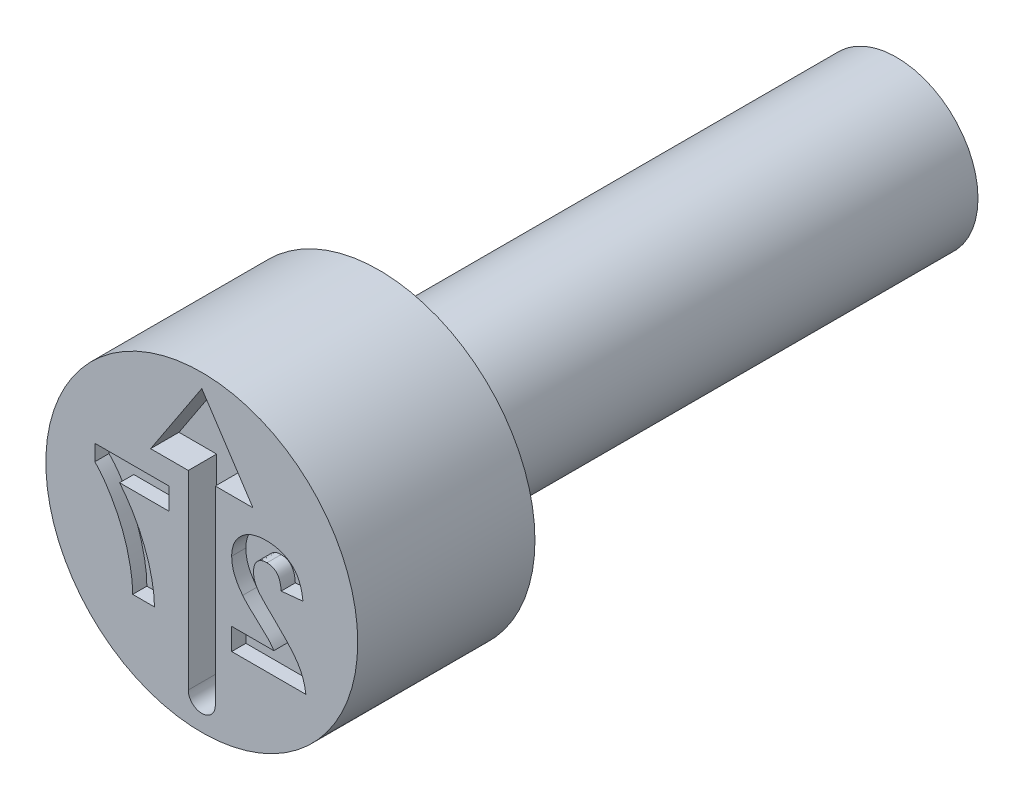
ISO-10303-21;
HEADER;
FILE_DESCRIPTION(('STEP AP214'),'2;1');
FILE_NAME('part.step','',(''),(''),'','','');
FILE_SCHEMA(('AUTOMOTIVE_DESIGN { 1 0 10303 214 1 1 1 1 }'));
ENDSEC;
DATA;
#1=APPLICATION_CONTEXT('core data for automotive mechanical design processes');
#2=APPLICATION_PROTOCOL_DEFINITION('international standard','automotive_design',2000,#1);
#3=PRODUCT_CONTEXT('',#1,'mechanical');
#4=PRODUCT('Part','Part','',(#3));
#5=PRODUCT_RELATED_PRODUCT_CATEGORY('part','',(#4));
#6=PRODUCT_DEFINITION_FORMATION('','',#4);
#7=PRODUCT_DEFINITION_CONTEXT('part definition',#1,'design');
#8=PRODUCT_DEFINITION('design','',#6,#7);
#9=PRODUCT_DEFINITION_SHAPE('','',#8);
#10=(LENGTH_UNIT() NAMED_UNIT(*) SI_UNIT(.MILLI.,.METRE.));
#11=(NAMED_UNIT(*) PLANE_ANGLE_UNIT() SI_UNIT($,.RADIAN.));
#12=(NAMED_UNIT(*) SI_UNIT($,.STERADIAN.) SOLID_ANGLE_UNIT());
#13=UNCERTAINTY_MEASURE_WITH_UNIT(LENGTH_MEASURE(1.E-05),#10,'distance_accuracy_value','');
#14=(GEOMETRIC_REPRESENTATION_CONTEXT(3) GLOBAL_UNCERTAINTY_ASSIGNED_CONTEXT((#13)) GLOBAL_UNIT_ASSIGNED_CONTEXT((#10,
#11,#12)) REPRESENTATION_CONTEXT('',''));
#15=CARTESIAN_POINT('',(0.,0.,0.));
#16=DIRECTION('',(0.,0.,1.));
#17=DIRECTION('',(1.,0.,0.));
#18=AXIS2_PLACEMENT_3D('',#15,#16,#17);
#19=CARTESIAN_POINT('',(0.,1.15,-2.5));
#20=DIRECTION('',(0.,0.,1.));
#21=DIRECTION('',(1.,0.,0.));
#22=AXIS2_PLACEMENT_3D('',#19,#20,#21);
#23=PLANE('',#22);
#24=CARTESIAN_POINT('',(0.,0.,-2.5));
#25=DIRECTION('',(0.,0.,1.));
#26=DIRECTION('',(1.,0.,0.));
#27=AXIS2_PLACEMENT_3D('',#24,#25,#26);
#28=CIRCLE('',#27,2.2);
#29=CARTESIAN_POINT('',(2.2,0.,-2.5));
#30=VERTEX_POINT('',#29);
#31=EDGE_CURVE('E11',#30,#30,#28,.T.);
#32=ORIENTED_EDGE('',*,*,#31,.F.);
#33=EDGE_LOOP('',(#32));
#34=FACE_BOUND('',#33,.T.);
#35=CARTESIAN_POINT('',(0.,0.,-2.5));
#36=DIRECTION('',(0.,0.,1.));
#37=DIRECTION('',(1.,0.,0.));
#38=AXIS2_PLACEMENT_3D('',#35,#36,#37);
#39=CIRCLE('',#38,1.15);
#40=CARTESIAN_POINT('',(1.15,0.,-2.5));
#41=VERTEX_POINT('',#40);
#42=EDGE_CURVE('E462',#41,#41,#39,.T.);
#43=ORIENTED_EDGE('',*,*,#42,.T.);
#44=EDGE_LOOP('',(#43));
#45=FACE_BOUND('',#44,.T.);
#46=ADVANCED_FACE('F39',(#34,#45),#23,.F.);
#47=CARTESIAN_POINT('',(0.,0.,-0.403888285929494));
#48=DIRECTION('',(0.,0.,1.));
#49=DIRECTION('',(1.,0.,0.));
#50=AXIS2_PLACEMENT_3D('',#47,#48,#49);
#51=CYLINDRICAL_SURFACE('',#50,2.2);
#52=CARTESIAN_POINT('',(0.,0.,0.));
#53=DIRECTION('',(0.,0.,1.));
#54=DIRECTION('',(1.,0.,0.));
#55=AXIS2_PLACEMENT_3D('',#52,#53,#54);
#56=CIRCLE('',#55,2.2);
#57=CARTESIAN_POINT('',(2.2,0.,0.));
#58=VERTEX_POINT('',#57);
#59=EDGE_CURVE('E46',#58,#58,#56,.T.);
#60=ORIENTED_EDGE('',*,*,#59,.F.);
#61=EDGE_LOOP('',(#60));
#62=FACE_BOUND('',#61,.T.);
#63=ORIENTED_EDGE('',*,*,#31,.T.);
#64=EDGE_LOOP('',(#63));
#65=FACE_BOUND('',#64,.T.);
#66=ADVANCED_FACE('F484',(#62,#65),#51,.T.);
#67=CARTESIAN_POINT('',(0.,2.2,0.));
#68=DIRECTION('',(0.,0.,-1.));
#69=DIRECTION('',(-1.,0.,0.));
#70=AXIS2_PLACEMENT_3D('',#67,#68,#69);
#71=PLANE('',#70);
#72=DIRECTION('',(0.,1.,0.));
#73=VECTOR('',#72,1.);
#74=CARTESIAN_POINT('',(-0.461897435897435,0.271794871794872,0.));
#75=LINE('',#74,#73);
#76=CARTESIAN_POINT('',(-0.461897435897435,0.271794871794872,0.));
#77=VERTEX_POINT('',#76);
#78=CARTESIAN_POINT('',(-0.461897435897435,0.57948717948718,0.));
#79=VERTEX_POINT('',#78);
#80=EDGE_CURVE('E708',#77,#79,#75,.T.);
#81=ORIENTED_EDGE('',*,*,#80,.F.);
#82=DIRECTION('',(1.,0.,0.));
#83=VECTOR('',#82,1.);
#84=CARTESIAN_POINT('',(-1.15965384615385,0.271794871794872,0.));
#85=LINE('',#84,#83);
#86=CARTESIAN_POINT('',(-1.15965384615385,0.271794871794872,0.));
#87=VERTEX_POINT('',#86);
#88=EDGE_CURVE('E53',#87,#77,#85,.T.);
#89=ORIENTED_EDGE('',*,*,#88,.F.);
#90=CARTESIAN_POINT('',(-0.66702564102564,-1.,0.));
#91=CARTESIAN_POINT('',(-0.668054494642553,-0.972742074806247,0.));
#92=CARTESIAN_POINT('',(-0.670123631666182,-0.917923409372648,0.));
#93=CARTESIAN_POINT('',(-0.677865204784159,-0.8356423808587,0.));
#94=CARTESIAN_POINT('',(-0.690024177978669,-0.753054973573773,0.));
#95=CARTESIAN_POINT('',(-0.705126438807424,-0.669970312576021,0.));
#96=CARTESIAN_POINT('',(-0.72506518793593,-0.586590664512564,0.));
#97=CARTESIAN_POINT('',(-0.747821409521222,-0.502607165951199,0.));
#98=CARTESIAN_POINT('',(-0.775387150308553,-0.418468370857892,0.));
#99=CARTESIAN_POINT('',(-0.806287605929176,-0.334335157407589,0.));
#100=CARTESIAN_POINT('',(-0.840400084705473,-0.251006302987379,0.));
#101=CARTESIAN_POINT('',(-0.877577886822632,-0.169515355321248,0.));
#102=CARTESIAN_POINT('',(-0.917724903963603,-0.0903707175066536,0.));
#103=CARTESIAN_POINT('',(-0.960319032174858,-0.0132943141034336,0.));
#104=CARTESIAN_POINT('',(-1.00585579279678,0.0614658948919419,0.));
#105=CARTESIAN_POINT('',(-1.05436947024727,0.133828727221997,0.));
#106=CARTESIAN_POINT('',(-1.10517191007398,0.204317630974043,0.));
#107=CARTESIAN_POINT('',(-1.14149626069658,0.249306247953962,0.));
#108=CARTESIAN_POINT('',(-1.15965384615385,0.271794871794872,0.));
#109=B_SPLINE_CURVE_WITH_KNOTS('',3,(#90,#91,#92,#93,#94,#95,#96,#97,#98,#99,#100,#101,#102,
#103,#104,#105,#106,#107,#108),.UNSPECIFIED.,.F.,.F.,(4,1,1,1,1,1,1,1,1,1,1,1,1,1,1,1,4),(0.,
0.0589531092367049,0.118561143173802,0.178522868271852,0.239353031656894,0.301026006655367,
0.363773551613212,0.427382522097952,0.492333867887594,0.557475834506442,0.621960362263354,
0.685889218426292,0.749254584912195,0.812267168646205,0.875035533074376,0.937533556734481,1.),.UNSPECIFIED.);
#110=CARTESIAN_POINT('',(-0.66702564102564,-1.,0.));
#111=VERTEX_POINT('',#110);
#112=EDGE_CURVE('E238',#111,#87,#109,.T.);
#113=ORIENTED_EDGE('',*,*,#112,.F.);
#114=DIRECTION('',(1.,0.,0.));
#115=VECTOR('',#114,1.);
#116=CARTESIAN_POINT('',(-0.974717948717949,-1.,0.));
#117=LINE('',#116,#115);
#118=CARTESIAN_POINT('',(-0.974717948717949,-1.,0.));
#119=VERTEX_POINT('',#118);
#120=EDGE_CURVE('E241',#119,#111,#117,.T.);
#121=ORIENTED_EDGE('',*,*,#120,.F.);
#122=CARTESIAN_POINT('',(-1.50805128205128,0.353846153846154,0.));
#123=CARTESIAN_POINT('',(-1.49713792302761,0.342742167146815,0.));
#124=CARTESIAN_POINT('',(-1.47470319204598,0.319915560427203,0.));
#125=CARTESIAN_POINT('',(-1.44256763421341,0.282557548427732,0.));
#126=CARTESIAN_POINT('',(-1.40995594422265,0.242017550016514,0.));
#127=CARTESIAN_POINT('',(-1.37755006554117,0.197749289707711,0.));
#128=CARTESIAN_POINT('',(-1.34434267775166,0.15045206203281,0.));
#129=CARTESIAN_POINT('',(-1.31179312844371,0.0992192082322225,0.));
#130=CARTESIAN_POINT('',(-1.27878060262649,0.0447153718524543,0.));
#131=CARTESIAN_POINT('',(-1.234335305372,-0.032380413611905,0.));
#132=CARTESIAN_POINT('',(-1.18238429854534,-0.133091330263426,0.));
#133=CARTESIAN_POINT('',(-1.12742288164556,-0.258280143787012,0.));
#134=CARTESIAN_POINT('',(-1.08059827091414,-0.387313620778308,0.));
#135=CARTESIAN_POINT('',(-1.04853483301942,-0.497259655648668,0.));
#136=CARTESIAN_POINT('',(-1.02687081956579,-0.585381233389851,0.));
#137=CARTESIAN_POINT('',(-1.01271660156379,-0.649817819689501,0.));
#138=CARTESIAN_POINT('',(-1.00080175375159,-0.712441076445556,0.));
#139=CARTESIAN_POINT('',(-0.991109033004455,-0.773361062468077,0.));
#140=CARTESIAN_POINT('',(-0.983875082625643,-0.832605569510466,0.));
#141=CARTESIAN_POINT('',(-0.978159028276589,-0.889968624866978,0.));
#142=CARTESIAN_POINT('',(-0.975338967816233,-0.94559010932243,0.));
#143=CARTESIAN_POINT('',(-0.974922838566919,-0.982048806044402,0.));
#144=CARTESIAN_POINT('',(-0.974717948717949,-1.,0.));
#145=B_SPLINE_CURVE_WITH_KNOTS('',3,(#122,#123,#124,#125,#126,#127,#128,#129,#130,#131,#132,
#133,#134,#135,#136,#137,#138,#139,#140,#141,#142,#143,#144),.UNSPECIFIED.,.F.,.F.,(4,1,1,1,1,1,
1,1,1,1,1,1,1,1,1,1,1,1,1,1,4),(0.,0.0314272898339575,0.0646054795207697,0.0994393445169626,
0.136456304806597,0.175351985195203,0.216100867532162,0.258977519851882,0.304007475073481,
0.395756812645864,0.487615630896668,0.579873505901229,0.672707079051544,0.718694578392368,
0.76307923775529,0.805893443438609,0.847386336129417,0.88760014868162,0.926386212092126,
0.963754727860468,1.),.UNSPECIFIED.);
#146=CARTESIAN_POINT('',(-1.50805128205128,0.353846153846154,0.));
#147=VERTEX_POINT('',#146);
#148=EDGE_CURVE('E694',#147,#119,#145,.T.);
#149=ORIENTED_EDGE('',*,*,#148,.F.);
#150=DIRECTION('',(0.,-1.,0.));
#151=VECTOR('',#150,1.);
#152=CARTESIAN_POINT('',(-1.50805128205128,0.57948717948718,0.));
#153=LINE('',#152,#151);
#154=CARTESIAN_POINT('',(-1.50805128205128,0.57948717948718,0.));
#155=VERTEX_POINT('',#154);
#156=EDGE_CURVE('E699',#155,#147,#153,.T.);
#157=ORIENTED_EDGE('',*,*,#156,.F.);
#158=DIRECTION('',(-1.,0.,0.));
#159=VECTOR('',#158,1.);
#160=CARTESIAN_POINT('',(-0.461897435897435,0.57948717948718,0.));
#161=LINE('',#160,#159);
#162=EDGE_CURVE('E705',#79,#155,#161,.T.);
#163=ORIENTED_EDGE('',*,*,#162,.F.);
#164=EDGE_LOOP('',(#81,#89,#113,#121,#149,#157,#163));
#165=FACE_BOUND('',#164,.T.);
#166=DIRECTION('',(0.,-1.,0.));
#167=VECTOR('',#166,1.);
#168=CARTESIAN_POINT('',(0.421794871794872,-0.692307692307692,0.));
#169=LINE('',#168,#167);
#170=CARTESIAN_POINT('',(0.421794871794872,-0.692307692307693,0.));
#171=VERTEX_POINT('',#170);
#172=CARTESIAN_POINT('',(0.421794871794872,-1.,0.));
#173=VERTEX_POINT('',#172);
#174=EDGE_CURVE('E310',#171,#173,#169,.T.);
#175=ORIENTED_EDGE('',*,*,#174,.F.);
#176=DIRECTION('',(-1.,0.,0.));
#177=VECTOR('',#176,1.);
#178=CARTESIAN_POINT('',(1.01634615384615,-0.692307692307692,0.));
#179=LINE('',#178,#177);
#180=CARTESIAN_POINT('',(1.01634615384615,-0.692307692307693,0.));
#181=VERTEX_POINT('',#180);
#182=EDGE_CURVE('E61',#181,#171,#179,.T.);
#183=ORIENTED_EDGE('',*,*,#182,.F.);
#184=CARTESIAN_POINT('',(0.576923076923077,-0.236538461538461,0.));
#185=CARTESIAN_POINT('',(0.581789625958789,-0.242667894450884,0.));
#186=CARTESIAN_POINT('',(0.592212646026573,-0.255795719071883,0.));
#187=CARTESIAN_POINT('',(0.609944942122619,-0.275925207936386,0.));
#188=CARTESIAN_POINT('',(0.630495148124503,-0.297912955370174,0.));
#189=CARTESIAN_POINT('',(0.653573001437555,-0.322170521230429,0.));
#190=CARTESIAN_POINT('',(0.679940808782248,-0.347838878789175,0.));
#191=CARTESIAN_POINT('',(0.708649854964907,-0.375991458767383,0.));
#192=CARTESIAN_POINT('',(0.74096342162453,-0.405188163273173,0.));
#193=CARTESIAN_POINT('',(0.774432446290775,-0.43615730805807,0.));
#194=CARTESIAN_POINT('',(0.808046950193,-0.466299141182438,0.));
#195=CARTESIAN_POINT('',(0.83894352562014,-0.494927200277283,0.));
#196=CARTESIAN_POINT('',(0.867007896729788,-0.520256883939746,0.));
#197=CARTESIAN_POINT('',(0.890933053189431,-0.543686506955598,0.));
#198=CARTESIAN_POINT('',(0.912126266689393,-0.563617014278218,0.));
#199=CARTESIAN_POINT('',(0.929823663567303,-0.581070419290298,0.));
#200=CARTESIAN_POINT('',(0.944356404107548,-0.595624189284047,0.));
#201=CARTESIAN_POINT('',(0.964381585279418,-0.618309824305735,0.));
#202=CARTESIAN_POINT('',(0.989861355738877,-0.648992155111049,0.));
#203=CARTESIAN_POINT('',(1.00778741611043,-0.678309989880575,0.));
#204=CARTESIAN_POINT('',(1.01634615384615,-0.692307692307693,0.));
#205=B_SPLINE_CURVE_WITH_KNOTS('',3,(#184,#185,#186,#187,#188,#189,#190,#191,#192,#193,#194,
#195,#196,#197,#198,#199,#200,#201,#202,#203,#204),.UNSPECIFIED.,.F.,.F.,(4,1,1,1,1,1,1,1,1,1,1,
1,1,1,1,1,1,1,4),(0.,0.0369753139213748,0.0791925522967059,0.126700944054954,0.179184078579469,
0.237368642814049,0.300558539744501,0.369153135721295,0.443112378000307,0.516018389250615,
0.582473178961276,0.642136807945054,0.694619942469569,0.740679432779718,0.779589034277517,
0.812073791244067,0.837814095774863,0.922564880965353,1.),.UNSPECIFIED.);
#206=CARTESIAN_POINT('',(0.576923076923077,-0.236538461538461,0.));
#207=VERTEX_POINT('',#206);
#208=EDGE_CURVE('E381',#207,#181,#205,.T.);
#209=ORIENTED_EDGE('',*,*,#208,.F.);
#210=CARTESIAN_POINT('',(0.421794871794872,0.16474358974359,0.));
#211=CARTESIAN_POINT('',(0.422186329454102,0.147302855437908,0.));
#212=CARTESIAN_POINT('',(0.422962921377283,0.112703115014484,0.));
#213=CARTESIAN_POINT('',(0.430398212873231,0.061554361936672,0.));
#214=CARTESIAN_POINT('',(0.441757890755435,0.0115850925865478,0.));
#215=CARTESIAN_POINT('',(0.458546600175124,-0.0373268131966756,0.));
#216=CARTESIAN_POINT('',(0.479827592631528,-0.0863546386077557,0.));
#217=CARTESIAN_POINT('',(0.507259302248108,-0.135608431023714,0.));
#218=CARTESIAN_POINT('',(0.53910959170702,-0.186573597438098,0.));
#219=CARTESIAN_POINT('',(0.56404711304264,-0.219524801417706,0.));
#220=CARTESIAN_POINT('',(0.576923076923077,-0.236538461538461,0.));
#221=B_SPLINE_CURVE_WITH_KNOTS('',3,(#210,#211,#212,#213,#214,#215,#216,#217,#218,#219,#220),
.UNSPECIFIED.,.F.,.F.,(4,1,1,1,1,1,1,1,4),(0.,0.119176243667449,0.236427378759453,
0.352663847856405,0.469086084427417,0.589462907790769,0.717601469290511,0.854189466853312,1.),.UNSPECIFIED.);
#222=CARTESIAN_POINT('',(0.421794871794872,0.16474358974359,0.));
#223=VERTEX_POINT('',#222);
#224=EDGE_CURVE('E373',#223,#207,#221,.T.);
#225=ORIENTED_EDGE('',*,*,#224,.F.);
#226=CARTESIAN_POINT('',(0.912820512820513,0.6,0.));
#227=CARTESIAN_POINT('',(0.894217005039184,0.599642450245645,0.));
#228=CARTESIAN_POINT('',(0.857984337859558,0.598946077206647,0.));
#229=CARTESIAN_POINT('',(0.805091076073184,0.593195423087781,0.));
#230=CARTESIAN_POINT('',(0.755401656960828,0.583168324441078,0.));
#231=CARTESIAN_POINT('',(0.708481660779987,0.569886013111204,0.));
#232=CARTESIAN_POINT('',(0.664812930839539,0.552153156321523,0.));
#233=CARTESIAN_POINT('',(0.624031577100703,0.530714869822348,0.));
#234=CARTESIAN_POINT('',(0.586779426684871,0.504757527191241,0.));
#235=CARTESIAN_POINT('',(0.552501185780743,0.475696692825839,0.));
#236=CARTESIAN_POINT('',(0.521859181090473,0.443739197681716,0.));
#237=CARTESIAN_POINT('',(0.495019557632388,0.409651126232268,0.));
#238=CARTESIAN_POINT('',(0.472533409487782,0.373456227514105,0.));
#239=CARTESIAN_POINT('',(0.453664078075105,0.335595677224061,0.));
#240=CARTESIAN_POINT('',(0.439653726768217,0.295460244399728,0.));
#241=CARTESIAN_POINT('',(0.42944517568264,0.253604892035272,0.));
#242=CARTESIAN_POINT('',(0.422676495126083,0.209834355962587,0.));
#243=CARTESIAN_POINT('',(0.422091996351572,0.179940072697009,0.));
#244=CARTESIAN_POINT('',(0.421794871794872,0.16474358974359,0.));
#245=B_SPLINE_CURVE_WITH_KNOTS('',3,(#226,#227,#228,#229,#230,#231,#232,#233,#234,#235,#236,
#237,#238,#239,#240,#241,#242,#243,#244),.UNSPECIFIED.,.F.,.F.,(4,1,1,1,1,1,1,1,1,1,1,1,1,1,1,1,
4),(0.,0.0756723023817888,0.147381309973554,0.216084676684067,0.28169803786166,
0.345459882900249,0.407485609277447,0.46873129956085,0.529782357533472,0.590032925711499,
0.648548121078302,0.70595351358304,0.763101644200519,0.820289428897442,0.878479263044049,
0.938226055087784,1.),.UNSPECIFIED.);
#246=CARTESIAN_POINT('',(0.912820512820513,0.6,0.));
#247=VERTEX_POINT('',#246);
#248=EDGE_CURVE('E365',#247,#223,#245,.T.);
#249=ORIENTED_EDGE('',*,*,#248,.F.);
#250=CARTESIAN_POINT('',(1.42692307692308,0.117307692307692,0.));
#251=CARTESIAN_POINT('',(1.4244492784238,0.138080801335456,0.));
#252=CARTESIAN_POINT('',(1.4196529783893,0.178356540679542,0.));
#253=CARTESIAN_POINT('',(1.40768373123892,0.236206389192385,0.));
#254=CARTESIAN_POINT('',(1.39252512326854,0.289575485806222,0.));
#255=CARTESIAN_POINT('',(1.37345449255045,0.338364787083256,0.));
#256=CARTESIAN_POINT('',(1.35126005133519,0.382884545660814,0.));
#257=CARTESIAN_POINT('',(1.32480969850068,0.422466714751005,0.));
#258=CARTESIAN_POINT('',(1.29502763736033,0.457549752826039,0.));
#259=CARTESIAN_POINT('',(1.26188812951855,0.488114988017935,0.));
#260=CARTESIAN_POINT('',(1.225601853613,0.514259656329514,0.));
#261=CARTESIAN_POINT('',(1.18752591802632,0.537597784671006,0.));
#262=CARTESIAN_POINT('',(1.14691621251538,0.556742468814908,0.));
#263=CARTESIAN_POINT('',(1.10421985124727,0.572520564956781,0.));
#264=CARTESIAN_POINT('',(1.05945612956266,0.585130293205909,0.));
#265=CARTESIAN_POINT('',(1.01241800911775,0.593467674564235,0.));
#266=CARTESIAN_POINT('',(0.963395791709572,0.599332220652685,0.));
#267=CARTESIAN_POINT('',(0.929933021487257,0.599774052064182,0.));
#268=CARTESIAN_POINT('',(0.912820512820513,0.6,0.));
#269=B_SPLINE_CURVE_WITH_KNOTS('',3,(#250,#251,#252,#253,#254,#255,#256,#257,#258,#259,#260,
#261,#262,#263,#264,#265,#266,#267,#268),.UNSPECIFIED.,.F.,.F.,(4,1,1,1,1,1,1,1,1,1,1,1,1,1,1,1,
4),(0.,0.0794357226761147,0.154013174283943,0.224141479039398,0.289934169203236,
0.352732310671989,0.412725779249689,0.470302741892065,0.527168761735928,0.583502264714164,
0.639948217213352,0.696584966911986,0.753726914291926,0.812707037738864,0.872963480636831,
0.935034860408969,1.),.UNSPECIFIED.);
#270=CARTESIAN_POINT('',(1.42692307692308,0.117307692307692,0.));
#271=VERTEX_POINT('',#270);
#272=EDGE_CURVE('E360',#271,#247,#269,.T.);
#273=ORIENTED_EDGE('',*,*,#272,.F.);
#274=DIRECTION('',(0.995240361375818,0.0974506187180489,0.));
#275=VECTOR('',#274,1.);
#276=CARTESIAN_POINT('',(1.11923076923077,0.0871794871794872,0.));
#277=LINE('',#276,#275);
#278=CARTESIAN_POINT('',(1.11923076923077,0.0871794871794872,0.));
#279=VERTEX_POINT('',#278);
#280=EDGE_CURVE('E354',#279,#271,#277,.T.);
#281=ORIENTED_EDGE('',*,*,#280,.F.);
#282=CARTESIAN_POINT('',(0.919230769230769,0.333333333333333,0.));
#283=CARTESIAN_POINT('',(0.933186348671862,0.332701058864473,0.));
#284=CARTESIAN_POINT('',(0.96014551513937,0.331479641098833,0.));
#285=CARTESIAN_POINT('',(0.998460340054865,0.320809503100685,0.));
#286=CARTESIAN_POINT('',(1.03197874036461,0.302338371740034,0.));
#287=CARTESIAN_POINT('',(1.05586573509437,0.281288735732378,0.));
#288=CARTESIAN_POINT('',(1.07200253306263,0.260819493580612,0.));
#289=CARTESIAN_POINT('',(1.08299758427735,0.242981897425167,0.));
#290=CARTESIAN_POINT('',(1.0924744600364,0.222712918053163,0.));
#291=CARTESIAN_POINT('',(1.10087176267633,0.200240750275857,0.));
#292=CARTESIAN_POINT('',(1.10750468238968,0.175307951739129,0.));
#293=CARTESIAN_POINT('',(1.11284642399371,0.148104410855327,0.));
#294=CARTESIAN_POINT('',(1.11715109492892,0.118483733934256,0.));
#295=CARTESIAN_POINT('',(1.11852005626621,0.0978774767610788,0.));
#296=CARTESIAN_POINT('',(1.11923076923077,0.0871794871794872,0.));
#297=B_SPLINE_CURVE_WITH_KNOTS('',3,(#282,#283,#284,#285,#286,#287,#288,#289,#290,#291,#292,
#293,#294,#295,#296),.UNSPECIFIED.,.F.,.F.,(4,1,1,1,1,1,1,1,1,1,1,1,4),(0.,0.116899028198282,
0.225823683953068,0.330086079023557,0.435451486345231,0.490306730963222,0.548244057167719,
0.610766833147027,0.677675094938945,0.749188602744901,0.826858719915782,0.910111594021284,1.),.UNSPECIFIED.);
#298=CARTESIAN_POINT('',(0.919230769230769,0.333333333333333,0.));
#299=VERTEX_POINT('',#298);
#300=EDGE_CURVE('E346',#299,#279,#297,.T.);
#301=ORIENTED_EDGE('',*,*,#300,.F.);
#302=CARTESIAN_POINT('',(0.729487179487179,0.123397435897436,0.));
#303=CARTESIAN_POINT('',(0.730063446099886,0.139361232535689,0.));
#304=CARTESIAN_POINT('',(0.731153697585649,0.16956349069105,0.));
#305=CARTESIAN_POINT('',(0.740295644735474,0.21218446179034,0.));
#306=CARTESIAN_POINT('',(0.756507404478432,0.248823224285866,0.));
#307=CARTESIAN_POINT('',(0.77882801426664,0.279592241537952,0.));
#308=CARTESIAN_POINT('',(0.807052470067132,0.303699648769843,0.));
#309=CARTESIAN_POINT('',(0.840047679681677,0.3215126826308,0.));
#310=CARTESIAN_POINT('',(0.87829664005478,0.33136096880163,0.));
#311=CARTESIAN_POINT('',(0.905180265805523,0.3326563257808,0.));
#312=CARTESIAN_POINT('',(0.919230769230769,0.333333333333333,0.));
#313=B_SPLINE_CURVE_WITH_KNOTS('',3,(#302,#303,#304,#305,#306,#307,#308,#309,#310,#311,#312),
.UNSPECIFIED.,.F.,.F.,(4,1,1,1,1,1,1,1,4),(0.,0.149140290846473,0.282161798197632,
0.404655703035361,0.521109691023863,0.634416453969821,0.748796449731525,0.868710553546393,1.),.UNSPECIFIED.);
#314=CARTESIAN_POINT('',(0.729487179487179,0.123397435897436,0.));
#315=VERTEX_POINT('',#314);
#316=EDGE_CURVE('E338',#315,#299,#313,.T.);
#317=ORIENTED_EDGE('',*,*,#316,.F.);
#318=CARTESIAN_POINT('',(0.790384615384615,-0.0615384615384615,0.));
#319=CARTESIAN_POINT('',(0.781120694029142,-0.0461500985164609,0.));
#320=CARTESIAN_POINT('',(0.763251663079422,-0.0164677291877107,0.));
#321=CARTESIAN_POINT('',(0.743656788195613,0.0302083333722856,0.));
#322=CARTESIAN_POINT('',(0.731895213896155,0.076874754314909,0.));
#323=CARTESIAN_POINT('',(0.730281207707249,0.108056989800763,0.));
#324=CARTESIAN_POINT('',(0.729487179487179,0.123397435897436,0.));
#325=B_SPLINE_CURVE_WITH_KNOTS('',3,(#318,#319,#320,#321,#322,#323,#324),.UNSPECIFIED.,.F.,.F.,
(4,1,1,1,4),(0.,0.272795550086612,0.526191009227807,0.766904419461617,1.),.UNSPECIFIED.);
#326=CARTESIAN_POINT('',(0.790384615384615,-0.0615384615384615,0.));
#327=VERTEX_POINT('',#326);
#328=EDGE_CURVE('E330',#327,#315,#325,.T.);
#329=ORIENTED_EDGE('',*,*,#328,.F.);
#330=CARTESIAN_POINT('',(1.03525641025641,-0.319871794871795,0.));
#331=CARTESIAN_POINT('',(1.01943716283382,-0.304601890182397,0.));
#332=CARTESIAN_POINT('',(0.989321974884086,-0.275532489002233,0.));
#333=CARTESIAN_POINT('',(0.946437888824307,-0.233906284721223,0.));
#334=CARTESIAN_POINT('',(0.908738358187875,-0.195639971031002,0.));
#335=CARTESIAN_POINT('',(0.875435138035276,-0.161725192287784,0.));
#336=CARTESIAN_POINT('',(0.847297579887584,-0.131298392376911,0.));
#337=CARTESIAN_POINT('',(0.82395555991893,-0.10483741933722,0.));
#338=CARTESIAN_POINT('',(0.805113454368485,-0.0822345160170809,0.));
#339=CARTESIAN_POINT('',(0.794908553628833,-0.0678952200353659,0.));
#340=CARTESIAN_POINT('',(0.790384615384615,-0.0615384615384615,0.));
#341=B_SPLINE_CURVE_WITH_KNOTS('',3,(#330,#331,#332,#333,#334,#335,#336,#337,#338,#339,#340),
.UNSPECIFIED.,.F.,.F.,(4,1,1,1,1,1,1,1,4),(0.,0.18509006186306,0.352356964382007,
0.503079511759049,0.637279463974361,0.752473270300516,0.851885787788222,0.934339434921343,1.),.UNSPECIFIED.);
#342=CARTESIAN_POINT('',(1.03525641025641,-0.319871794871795,0.));
#343=VERTEX_POINT('',#342);
#344=EDGE_CURVE('E322',#343,#327,#341,.T.);
#345=ORIENTED_EDGE('',*,*,#344,.F.);
#346=CARTESIAN_POINT('',(1.46794871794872,-1.,0.));
#347=CARTESIAN_POINT('',(1.4644066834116,-0.973703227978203,0.));
#348=CARTESIAN_POINT('',(1.45732460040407,-0.921124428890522,0.));
#349=CARTESIAN_POINT('',(1.43542933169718,-0.844320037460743,0.));
#350=CARTESIAN_POINT('',(1.40620664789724,-0.769372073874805,0.));
#351=CARTESIAN_POINT('',(1.3744909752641,-0.708382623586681,0.));
#352=CARTESIAN_POINT('',(1.34294622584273,-0.659288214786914,0.));
#353=CARTESIAN_POINT('',(1.31432567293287,-0.619059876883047,0.));
#354=CARTESIAN_POINT('',(1.28018240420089,-0.576258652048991,0.));
#355=CARTESIAN_POINT('',(1.24101187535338,-0.530539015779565,0.));
#356=CARTESIAN_POINT('',(1.19703055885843,-0.481758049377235,0.));
#357=CARTESIAN_POINT('',(1.14791032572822,-0.430097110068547,0.));
#358=CARTESIAN_POINT('',(1.09341686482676,-0.375803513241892,0.));
#359=CARTESIAN_POINT('',(1.0550797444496,-0.33893548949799,0.));
#360=CARTESIAN_POINT('',(1.03525641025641,-0.319871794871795,0.));
#361=B_SPLINE_CURVE_WITH_KNOTS('',3,(#346,#347,#348,#349,#350,#351,#352,#353,#354,#355,#356,
#357,#358,#359,#360),.UNSPECIFIED.,.F.,.F.,(4,1,1,1,1,1,1,1,1,1,1,1,4),(0.,0.0963574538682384,
0.192660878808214,0.289454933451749,0.388479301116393,0.441921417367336,0.501521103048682,
0.567882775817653,0.640891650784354,0.72037065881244,0.806636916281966,0.900015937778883,1.),.UNSPECIFIED.);
#362=CARTESIAN_POINT('',(1.46794871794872,-1.,0.));
#363=VERTEX_POINT('',#362);
#364=EDGE_CURVE('E317',#363,#343,#361,.T.);
#365=ORIENTED_EDGE('',*,*,#364,.F.);
#366=DIRECTION('',(1.,0.,0.));
#367=VECTOR('',#366,1.);
#368=CARTESIAN_POINT('',(0.421794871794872,-1.,0.));
#369=LINE('',#368,#367);
#370=EDGE_CURVE('E314',#173,#363,#369,.T.);
#371=ORIENTED_EDGE('',*,*,#370,.F.);
#372=EDGE_LOOP('',(#175,#183,#209,#225,#249,#273,#281,#301,#317,#329,#345,#365,#371));
#373=FACE_BOUND('',#372,.T.);
#374=DIRECTION('',(0.,1.,0.));
#375=VECTOR('',#374,1.);
#376=CARTESIAN_POINT('',(0.190473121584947,0.906351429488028,0.));
#377=LINE('',#376,#375);
#378=CARTESIAN_POINT('',(0.190473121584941,-1.77616183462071,0.));
#379=VERTEX_POINT('',#378);
#380=CARTESIAN_POINT('',(0.190473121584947,0.906351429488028,0.));
#381=VERTEX_POINT('',#380);
#382=EDGE_CURVE('E443',#379,#381,#377,.T.);
#383=ORIENTED_EDGE('',*,*,#382,.F.);
#384=CARTESIAN_POINT('',(1.6342449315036E-13,-1.77616183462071,0.));
#385=DIRECTION('',(0.,0.,1.));
#386=DIRECTION('',(1.,0.,0.));
#387=AXIS2_PLACEMENT_3D('',#384,#385,#386);
#388=CIRCLE('',#387,0.190473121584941);
#389=CARTESIAN_POINT('',(-0.190473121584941,-1.77616183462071,0.));
#390=VERTEX_POINT('',#389);
#391=EDGE_CURVE('E395',#390,#379,#388,.T.);
#392=ORIENTED_EDGE('',*,*,#391,.F.);
#393=DIRECTION('',(0.,-1.,0.));
#394=VECTOR('',#393,1.);
#395=CARTESIAN_POINT('',(-0.190473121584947,0.906351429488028,0.));
#396=LINE('',#395,#394);
#397=CARTESIAN_POINT('',(-0.190473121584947,0.906351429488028,0.));
#398=VERTEX_POINT('',#397);
#399=EDGE_CURVE('E423',#398,#390,#396,.T.);
#400=ORIENTED_EDGE('',*,*,#399,.F.);
#401=DIRECTION('',(1.,0.,0.));
#402=VECTOR('',#401,1.);
#403=CARTESIAN_POINT('',(-0.721917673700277,0.906351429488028,0.));
#404=LINE('',#403,#402);
#405=CARTESIAN_POINT('',(-0.721917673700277,0.906351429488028,0.));
#406=VERTEX_POINT('',#405);
#407=EDGE_CURVE('E455',#406,#398,#404,.T.);
#408=ORIENTED_EDGE('',*,*,#407,.F.);
#409=DIRECTION('',(-0.550159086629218,-0.835059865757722,0.));
#410=VECTOR('',#409,1.);
#411=CARTESIAN_POINT('',(0.,2.00211534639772,0.));
#412=LINE('',#411,#410);
#413=CARTESIAN_POINT('',(0.,2.00211534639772,0.));
#414=VERTEX_POINT('',#413);
#415=EDGE_CURVE('E452',#414,#406,#412,.T.);
#416=ORIENTED_EDGE('',*,*,#415,.F.);
#417=DIRECTION('',(-0.550159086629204,0.835059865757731,0.));
#418=VECTOR('',#417,1.);
#419=CARTESIAN_POINT('',(0.,2.00211534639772,0.));
#420=LINE('',#419,#418);
#421=CARTESIAN_POINT('',(0.721917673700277,0.906351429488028,0.));
#422=VERTEX_POINT('',#421);
#423=EDGE_CURVE('E449',#422,#414,#420,.T.);
#424=ORIENTED_EDGE('',*,*,#423,.F.);
#425=DIRECTION('',(1.,0.,0.));
#426=VECTOR('',#425,1.);
#427=CARTESIAN_POINT('',(0.721917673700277,0.906351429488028,0.));
#428=LINE('',#427,#426);
#429=EDGE_CURVE('E446',#381,#422,#428,.T.);
#430=ORIENTED_EDGE('',*,*,#429,.F.);
#431=EDGE_LOOP('',(#383,#392,#400,#408,#416,#424,#430));
#432=FACE_BOUND('',#431,.T.);
#433=ORIENTED_EDGE('',*,*,#59,.T.);
#434=EDGE_LOOP('',(#433));
#435=FACE_BOUND('',#434,.T.);
#436=ADVANCED_FACE('F482',(#165,#373,#432,#435),#71,.F.);
#437=CARTESIAN_POINT('',(0.,0.,-9.8));
#438=DIRECTION('',(0.,0.,1.));
#439=DIRECTION('',(1.,0.,0.));
#440=AXIS2_PLACEMENT_3D('',#437,#438,#439);
#441=PLANE('',#440);
#442=CARTESIAN_POINT('',(0.,0.,-9.8));
#443=DIRECTION('',(0.,0.,1.));
#444=DIRECTION('',(1.,0.,0.));
#445=AXIS2_PLACEMENT_3D('',#442,#443,#444);
#446=CIRCLE('',#445,1.15);
#447=CARTESIAN_POINT('',(1.15,0.,-9.8));
#448=VERTEX_POINT('',#447);
#449=EDGE_CURVE('E477',#448,#448,#446,.T.);
#450=ORIENTED_EDGE('',*,*,#449,.F.);
#451=EDGE_LOOP('',(#450));
#452=FACE_BOUND('',#451,.T.);
#453=ADVANCED_FACE('F497',(#452),#441,.F.);
#454=CARTESIAN_POINT('',(0.,0.,-0.403888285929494));
#455=DIRECTION('',(0.,0.,1.));
#456=DIRECTION('',(1.,0.,0.));
#457=AXIS2_PLACEMENT_3D('',#454,#455,#456);
#458=CYLINDRICAL_SURFACE('',#457,1.15);
#459=ORIENTED_EDGE('',*,*,#42,.F.);
#460=EDGE_LOOP('',(#459));
#461=FACE_BOUND('',#460,.T.);
#462=ORIENTED_EDGE('',*,*,#449,.T.);
#463=EDGE_LOOP('',(#462));
#464=FACE_BOUND('',#463,.T.);
#465=ADVANCED_FACE('F493',(#461,#464),#458,.T.);
#466=CARTESIAN_POINT('',(1.6342449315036E-13,-1.77616183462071,-0.4));
#467=DIRECTION('',(0.,0.,1.));
#468=DIRECTION('',(1.,0.,0.));
#469=AXIS2_PLACEMENT_3D('',#466,#467,#468);
#470=CYLINDRICAL_SURFACE('',#469,0.190473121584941);
#471=ORIENTED_EDGE('',*,*,#391,.T.);
#472=DIRECTION('',(0.,0.,1.));
#473=VECTOR('',#472,1.);
#474=CARTESIAN_POINT('',(0.190473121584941,-1.77616183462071,-0.4));
#475=LINE('',#474,#473);
#476=CARTESIAN_POINT('',(0.190473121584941,-1.77616183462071,-0.4));
#477=VERTEX_POINT('',#476);
#478=EDGE_CURVE('E441',#477,#379,#475,.T.);
#479=ORIENTED_EDGE('',*,*,#478,.F.);
#480=CARTESIAN_POINT('',(1.6342449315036E-13,-1.77616183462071,-0.4));
#481=DIRECTION('',(0.,0.,1.));
#482=DIRECTION('',(1.,0.,0.));
#483=AXIS2_PLACEMENT_3D('',#480,#481,#482);
#484=CIRCLE('',#483,0.190473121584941);
#485=CARTESIAN_POINT('',(-0.190473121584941,-1.77616183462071,-0.4));
#486=VERTEX_POINT('',#485);
#487=EDGE_CURVE('E419',#486,#477,#484,.T.);
#488=ORIENTED_EDGE('',*,*,#487,.F.);
#489=DIRECTION('',(0.,0.,1.));
#490=VECTOR('',#489,1.);
#491=CARTESIAN_POINT('',(-0.190473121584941,-1.77616183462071,-0.4));
#492=LINE('',#491,#490);
#493=EDGE_CURVE('E460',#486,#390,#492,.T.);
#494=ORIENTED_EDGE('',*,*,#493,.T.);
#495=EDGE_LOOP('',(#471,#479,#488,#494));
#496=FACE_BOUND('',#495,.T.);
#497=ADVANCED_FACE('F496',(#496),#470,.F.);
#498=CARTESIAN_POINT('',(-0.190473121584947,0.906351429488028,-0.4));
#499=DIRECTION('',(-1.,0.,0.));
#500=DIRECTION('',(0.,-1.,0.));
#501=AXIS2_PLACEMENT_3D('',#498,#499,#500);
#502=PLANE('',#501);
#503=ORIENTED_EDGE('',*,*,#399,.T.);
#504=ORIENTED_EDGE('',*,*,#493,.F.);
#505=DIRECTION('',(0.,-1.,0.));
#506=VECTOR('',#505,1.);
#507=CARTESIAN_POINT('',(-0.190473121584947,0.906351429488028,-0.4));
#508=LINE('',#507,#506);
#509=CARTESIAN_POINT('',(-0.190473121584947,0.906351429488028,-0.4));
#510=VERTEX_POINT('',#509);
#511=EDGE_CURVE('E438',#510,#486,#508,.T.);
#512=ORIENTED_EDGE('',*,*,#511,.F.);
#513=DIRECTION('',(0.,0.,1.));
#514=VECTOR('',#513,1.);
#515=CARTESIAN_POINT('',(-0.190473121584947,0.906351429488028,-0.4));
#516=LINE('',#515,#514);
#517=EDGE_CURVE('E463',#510,#398,#516,.T.);
#518=ORIENTED_EDGE('',*,*,#517,.T.);
#519=EDGE_LOOP('',(#503,#504,#512,#518));
#520=FACE_BOUND('',#519,.T.);
#521=ADVANCED_FACE('F511',(#520),#502,.F.);
#522=CARTESIAN_POINT('',(-0.721917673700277,0.906351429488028,-0.4));
#523=DIRECTION('',(0.,-1.,0.));
#524=DIRECTION('',(0.,0.,-1.));
#525=AXIS2_PLACEMENT_3D('',#522,#523,#524);
#526=PLANE('',#525);
#527=ORIENTED_EDGE('',*,*,#407,.T.);
#528=ORIENTED_EDGE('',*,*,#517,.F.);
#529=DIRECTION('',(1.,0.,0.));
#530=VECTOR('',#529,1.);
#531=CARTESIAN_POINT('',(-0.721917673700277,0.906351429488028,-0.4));
#532=LINE('',#531,#530);
#533=CARTESIAN_POINT('',(-0.721917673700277,0.906351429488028,-0.4));
#534=VERTEX_POINT('',#533);
#535=EDGE_CURVE('E435',#534,#510,#532,.T.);
#536=ORIENTED_EDGE('',*,*,#535,.F.);
#537=DIRECTION('',(0.,0.,1.));
#538=VECTOR('',#537,1.);
#539=CARTESIAN_POINT('',(-0.721917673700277,0.906351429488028,-0.4));
#540=LINE('',#539,#538);
#541=EDGE_CURVE('E465',#534,#406,#540,.T.);
#542=ORIENTED_EDGE('',*,*,#541,.T.);
#543=EDGE_LOOP('',(#527,#528,#536,#542));
#544=FACE_BOUND('',#543,.T.);
#545=ADVANCED_FACE('F529',(#544),#526,.F.);
#546=CARTESIAN_POINT('',(0.,2.00211534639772,-0.4));
#547=DIRECTION('',(-0.835059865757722,0.550159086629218,0.));
#548=DIRECTION('',(-0.550159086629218,-0.835059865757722,0.));
#549=AXIS2_PLACEMENT_3D('',#546,#547,#548);
#550=PLANE('',#549);
#551=ORIENTED_EDGE('',*,*,#415,.T.);
#552=ORIENTED_EDGE('',*,*,#541,.F.);
#553=DIRECTION('',(-0.550159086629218,-0.835059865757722,0.));
#554=VECTOR('',#553,1.);
#555=CARTESIAN_POINT('',(0.,2.00211534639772,-0.4));
#556=LINE('',#555,#554);
#557=CARTESIAN_POINT('',(0.,2.00211534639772,-0.4));
#558=VERTEX_POINT('',#557);
#559=EDGE_CURVE('E432',#558,#534,#556,.T.);
#560=ORIENTED_EDGE('',*,*,#559,.F.);
#561=DIRECTION('',(0.,0.,1.));
#562=VECTOR('',#561,1.);
#563=CARTESIAN_POINT('',(0.,2.00211534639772,-0.4));
#564=LINE('',#563,#562);
#565=EDGE_CURVE('E467',#558,#414,#564,.T.);
#566=ORIENTED_EDGE('',*,*,#565,.T.);
#567=EDGE_LOOP('',(#551,#552,#560,#566));
#568=FACE_BOUND('',#567,.T.);
#569=ADVANCED_FACE('F525',(#568),#550,.F.);
#570=CARTESIAN_POINT('',(0.,2.00211534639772,-0.4));
#571=DIRECTION('',(0.835059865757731,0.550159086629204,0.));
#572=DIRECTION('',(-0.550159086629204,0.835059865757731,0.));
#573=AXIS2_PLACEMENT_3D('',#570,#571,#572);
#574=PLANE('',#573);
#575=ORIENTED_EDGE('',*,*,#423,.T.);
#576=ORIENTED_EDGE('',*,*,#565,.F.);
#577=DIRECTION('',(-0.550159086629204,0.835059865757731,0.));
#578=VECTOR('',#577,1.);
#579=CARTESIAN_POINT('',(0.,2.00211534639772,-0.4));
#580=LINE('',#579,#578);
#581=CARTESIAN_POINT('',(0.721917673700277,0.906351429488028,-0.4));
#582=VERTEX_POINT('',#581);
#583=EDGE_CURVE('E429',#582,#558,#580,.T.);
#584=ORIENTED_EDGE('',*,*,#583,.F.);
#585=DIRECTION('',(0.,0.,1.));
#586=VECTOR('',#585,1.);
#587=CARTESIAN_POINT('',(0.721917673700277,0.906351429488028,-0.4));
#588=LINE('',#587,#586);
#589=EDGE_CURVE('E469',#582,#422,#588,.T.);
#590=ORIENTED_EDGE('',*,*,#589,.T.);
#591=EDGE_LOOP('',(#575,#576,#584,#590));
#592=FACE_BOUND('',#591,.T.);
#593=ADVANCED_FACE('F521',(#592),#574,.F.);
#594=CARTESIAN_POINT('',(0.721917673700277,0.906351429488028,-0.4));
#595=DIRECTION('',(0.,-1.,0.));
#596=DIRECTION('',(0.,0.,-1.));
#597=AXIS2_PLACEMENT_3D('',#594,#595,#596);
#598=PLANE('',#597);
#599=ORIENTED_EDGE('',*,*,#429,.T.);
#600=ORIENTED_EDGE('',*,*,#589,.F.);
#601=DIRECTION('',(1.,0.,0.));
#602=VECTOR('',#601,1.);
#603=CARTESIAN_POINT('',(0.721917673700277,0.906351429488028,-0.4));
#604=LINE('',#603,#602);
#605=CARTESIAN_POINT('',(0.190473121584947,0.906351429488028,-0.4));
#606=VERTEX_POINT('',#605);
#607=EDGE_CURVE('E426',#606,#582,#604,.T.);
#608=ORIENTED_EDGE('',*,*,#607,.F.);
#609=DIRECTION('',(0.,0.,1.));
#610=VECTOR('',#609,1.);
#611=CARTESIAN_POINT('',(0.190473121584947,0.906351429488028,-0.4));
#612=LINE('',#611,#610);
#613=EDGE_CURVE('E471',#606,#381,#612,.T.);
#614=ORIENTED_EDGE('',*,*,#613,.T.);
#615=EDGE_LOOP('',(#599,#600,#608,#614));
#616=FACE_BOUND('',#615,.T.);
#617=ADVANCED_FACE('F517',(#616),#598,.F.);
#618=CARTESIAN_POINT('',(0.190473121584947,0.906351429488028,-0.4));
#619=DIRECTION('',(1.,0.,0.));
#620=DIRECTION('',(0.,1.,0.));
#621=AXIS2_PLACEMENT_3D('',#618,#619,#620);
#622=PLANE('',#621);
#623=ORIENTED_EDGE('',*,*,#382,.T.);
#624=ORIENTED_EDGE('',*,*,#613,.F.);
#625=DIRECTION('',(0.,1.,0.));
#626=VECTOR('',#625,1.);
#627=CARTESIAN_POINT('',(0.190473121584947,0.906351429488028,-0.4));
#628=LINE('',#627,#626);
#629=EDGE_CURVE('E422',#477,#606,#628,.T.);
#630=ORIENTED_EDGE('',*,*,#629,.F.);
#631=ORIENTED_EDGE('',*,*,#478,.T.);
#632=EDGE_LOOP('',(#623,#624,#630,#631));
#633=FACE_BOUND('',#632,.T.);
#634=ADVANCED_FACE('F513',(#633),#622,.F.);
#635=CARTESIAN_POINT('',(1.6342449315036E-13,-1.77616183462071,-0.4));
#636=DIRECTION('',(0.,0.,1.));
#637=DIRECTION('',(1.,0.,0.));
#638=AXIS2_PLACEMENT_3D('',#635,#636,#637);
#639=PLANE('',#638);
#640=ORIENTED_EDGE('',*,*,#487,.T.);
#641=ORIENTED_EDGE('',*,*,#629,.T.);
#642=ORIENTED_EDGE('',*,*,#607,.T.);
#643=ORIENTED_EDGE('',*,*,#583,.T.);
#644=ORIENTED_EDGE('',*,*,#559,.T.);
#645=ORIENTED_EDGE('',*,*,#535,.T.);
#646=ORIENTED_EDGE('',*,*,#511,.T.);
#647=EDGE_LOOP('',(#640,#641,#642,#643,#644,#645,#646));
#648=FACE_BOUND('',#647,.T.);
#649=ADVANCED_FACE('F516',(#648),#639,.T.);
#650=CARTESIAN_POINT('',(1.01634615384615,-0.692307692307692,-0.2));
#651=DIRECTION('',(0.,1.,0.));
#652=DIRECTION('',(0.,0.,1.));
#653=AXIS2_PLACEMENT_3D('',#650,#651,#652);
#654=PLANE('',#653);
#655=ORIENTED_EDGE('',*,*,#182,.T.);
#656=DIRECTION('',(0.,0.,1.));
#657=VECTOR('',#656,1.);
#658=CARTESIAN_POINT('',(0.421794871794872,-0.692307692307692,-0.2));
#659=LINE('',#658,#657);
#660=CARTESIAN_POINT('',(0.421794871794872,-0.692307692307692,-0.2));
#661=VERTEX_POINT('',#660);
#662=EDGE_CURVE('E300',#661,#171,#659,.T.);
#663=ORIENTED_EDGE('',*,*,#662,.F.);
#664=DIRECTION('',(-1.,0.,0.));
#665=VECTOR('',#664,1.);
#666=CARTESIAN_POINT('',(1.01634615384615,-0.692307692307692,-0.2));
#667=LINE('',#666,#665);
#668=CARTESIAN_POINT('',(1.01634615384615,-0.692307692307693,-0.2));
#669=VERTEX_POINT('',#668);
#670=EDGE_CURVE('E389',#669,#661,#667,.T.);
#671=ORIENTED_EDGE('',*,*,#670,.F.);
#672=DIRECTION('',(0.,0.,1.));
#673=VECTOR('',#672,1.);
#674=CARTESIAN_POINT('',(1.01634615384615,-0.692307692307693,-0.2));
#675=LINE('',#674,#673);
#676=EDGE_CURVE('E390',#669,#181,#675,.T.);
#677=ORIENTED_EDGE('',*,*,#676,.T.);
#678=EDGE_LOOP('',(#655,#663,#671,#677));
#679=FACE_BOUND('',#678,.T.);
#680=ADVANCED_FACE('F290',(#679),#654,.F.);
#681=CARTESIAN_POINT('',(0.576923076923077,-0.236538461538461,-0.2));
#682=CARTESIAN_POINT('',(0.581789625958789,-0.242667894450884,-0.2));
#683=CARTESIAN_POINT('',(0.592212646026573,-0.255795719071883,-0.2));
#684=CARTESIAN_POINT('',(0.609944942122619,-0.275925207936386,-0.2));
#685=CARTESIAN_POINT('',(0.630495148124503,-0.297912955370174,-0.2));
#686=CARTESIAN_POINT('',(0.653573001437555,-0.322170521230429,-0.2));
#687=CARTESIAN_POINT('',(0.679940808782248,-0.347838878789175,-0.2));
#688=CARTESIAN_POINT('',(0.708649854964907,-0.375991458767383,-0.2));
#689=CARTESIAN_POINT('',(0.74096342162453,-0.405188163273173,-0.2));
#690=CARTESIAN_POINT('',(0.774432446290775,-0.43615730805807,-0.2));
#691=CARTESIAN_POINT('',(0.808046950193,-0.466299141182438,-0.2));
#692=CARTESIAN_POINT('',(0.83894352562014,-0.494927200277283,-0.2));
#693=CARTESIAN_POINT('',(0.867007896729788,-0.520256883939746,-0.2));
#694=CARTESIAN_POINT('',(0.890933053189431,-0.543686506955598,-0.2));
#695=CARTESIAN_POINT('',(0.912126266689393,-0.563617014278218,-0.2));
#696=CARTESIAN_POINT('',(0.929823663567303,-0.581070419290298,-0.2));
#697=CARTESIAN_POINT('',(0.944356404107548,-0.595624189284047,-0.2));
#698=CARTESIAN_POINT('',(0.964381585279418,-0.618309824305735,-0.2));
#699=CARTESIAN_POINT('',(0.989861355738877,-0.648992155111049,-0.2));
#700=CARTESIAN_POINT('',(1.00778741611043,-0.678309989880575,-0.2));
#701=CARTESIAN_POINT('',(1.01634615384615,-0.692307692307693,-0.2));
#702=B_SPLINE_CURVE_WITH_KNOTS('',3,(#681,#682,#683,#684,#685,#686,#687,#688,#689,#690,#691,
#692,#693,#694,#695,#696,#697,#698,#699,#700,#701),.UNSPECIFIED.,.F.,.F.,(4,1,1,1,1,1,1,1,1,1,1,
1,1,1,1,1,1,1,4),(0.,0.0369753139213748,0.0791925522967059,0.126700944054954,0.179184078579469,
0.237368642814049,0.300558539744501,0.369153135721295,0.443112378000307,0.516018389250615,
0.582473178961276,0.642136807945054,0.694619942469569,0.740679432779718,0.779589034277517,
0.812073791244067,0.837814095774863,0.922564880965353,1.),.UNSPECIFIED.);
#703=DIRECTION('',(0.,0.,1.));
#704=VECTOR('',#703,1.);
#705=SURFACE_OF_LINEAR_EXTRUSION('',#702,#704);
#706=ORIENTED_EDGE('',*,*,#208,.T.);
#707=ORIENTED_EDGE('',*,*,#676,.F.);
#708=CARTESIAN_POINT('',(0.576923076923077,-0.236538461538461,-0.2));
#709=VERTEX_POINT('',#708);
#710=EDGE_CURVE('E294',#709,#669,#702,.T.);
#711=ORIENTED_EDGE('',*,*,#710,.F.);
#712=DIRECTION('',(0.,0.,1.));
#713=VECTOR('',#712,1.);
#714=CARTESIAN_POINT('',(0.576923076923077,-0.236538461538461,-0.2));
#715=LINE('',#714,#713);
#716=EDGE_CURVE('E396',#709,#207,#715,.T.);
#717=ORIENTED_EDGE('',*,*,#716,.T.);
#718=EDGE_LOOP('',(#706,#707,#711,#717));
#719=FACE_BOUND('',#718,.T.);
#720=ADVANCED_FACE('F285',(#719),#705,.F.);
#721=CARTESIAN_POINT('',(0.421794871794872,0.16474358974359,-0.2));
#722=CARTESIAN_POINT('',(0.422186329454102,0.147302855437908,-0.2));
#723=CARTESIAN_POINT('',(0.422962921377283,0.112703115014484,-0.2));
#724=CARTESIAN_POINT('',(0.430398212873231,0.061554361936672,-0.2));
#725=CARTESIAN_POINT('',(0.441757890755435,0.0115850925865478,-0.2));
#726=CARTESIAN_POINT('',(0.458546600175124,-0.0373268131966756,-0.2));
#727=CARTESIAN_POINT('',(0.479827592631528,-0.0863546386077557,-0.2));
#728=CARTESIAN_POINT('',(0.507259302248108,-0.135608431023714,-0.2));
#729=CARTESIAN_POINT('',(0.53910959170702,-0.186573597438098,-0.2));
#730=CARTESIAN_POINT('',(0.56404711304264,-0.219524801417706,-0.2));
#731=CARTESIAN_POINT('',(0.576923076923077,-0.236538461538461,-0.2));
#732=B_SPLINE_CURVE_WITH_KNOTS('',3,(#721,#722,#723,#724,#725,#726,#727,#728,#729,#730,#731),
.UNSPECIFIED.,.F.,.F.,(4,1,1,1,1,1,1,1,4),(0.,0.119176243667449,0.236427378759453,
0.352663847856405,0.469086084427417,0.589462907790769,0.717601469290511,0.854189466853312,1.),.UNSPECIFIED.);
#733=DIRECTION('',(0.,0.,1.));
#734=VECTOR('',#733,1.);
#735=SURFACE_OF_LINEAR_EXTRUSION('',#732,#734);
#736=ORIENTED_EDGE('',*,*,#224,.T.);
#737=ORIENTED_EDGE('',*,*,#716,.F.);
#738=CARTESIAN_POINT('',(0.421794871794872,0.16474358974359,-0.2));
#739=VERTEX_POINT('',#738);
#740=EDGE_CURVE('E301',#739,#709,#732,.T.);
#741=ORIENTED_EDGE('',*,*,#740,.F.);
#742=DIRECTION('',(0.,0.,1.));
#743=VECTOR('',#742,1.);
#744=CARTESIAN_POINT('',(0.421794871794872,0.16474358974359,-0.2));
#745=LINE('',#744,#743);
#746=EDGE_CURVE('E398',#739,#223,#745,.T.);
#747=ORIENTED_EDGE('',*,*,#746,.T.);
#748=EDGE_LOOP('',(#736,#737,#741,#747));
#749=FACE_BOUND('',#748,.T.);
#750=ADVANCED_FACE('F289',(#749),#735,.F.);
#751=CARTESIAN_POINT('',(0.912820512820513,0.6,-0.2));
#752=CARTESIAN_POINT('',(0.894217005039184,0.599642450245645,-0.2));
#753=CARTESIAN_POINT('',(0.857984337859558,0.598946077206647,-0.2));
#754=CARTESIAN_POINT('',(0.805091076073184,0.593195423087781,-0.2));
#755=CARTESIAN_POINT('',(0.755401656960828,0.583168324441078,-0.2));
#756=CARTESIAN_POINT('',(0.708481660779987,0.569886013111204,-0.2));
#757=CARTESIAN_POINT('',(0.664812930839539,0.552153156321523,-0.2));
#758=CARTESIAN_POINT('',(0.624031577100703,0.530714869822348,-0.2));
#759=CARTESIAN_POINT('',(0.586779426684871,0.504757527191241,-0.2));
#760=CARTESIAN_POINT('',(0.552501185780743,0.475696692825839,-0.2));
#761=CARTESIAN_POINT('',(0.521859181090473,0.443739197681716,-0.2));
#762=CARTESIAN_POINT('',(0.495019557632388,0.409651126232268,-0.2));
#763=CARTESIAN_POINT('',(0.472533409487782,0.373456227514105,-0.2));
#764=CARTESIAN_POINT('',(0.453664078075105,0.335595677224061,-0.2));
#765=CARTESIAN_POINT('',(0.439653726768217,0.295460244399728,-0.2));
#766=CARTESIAN_POINT('',(0.42944517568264,0.253604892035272,-0.2));
#767=CARTESIAN_POINT('',(0.422676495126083,0.209834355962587,-0.2));
#768=CARTESIAN_POINT('',(0.422091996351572,0.179940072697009,-0.2));
#769=CARTESIAN_POINT('',(0.421794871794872,0.16474358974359,-0.2));
#770=B_SPLINE_CURVE_WITH_KNOTS('',3,(#751,#752,#753,#754,#755,#756,#757,#758,#759,#760,#761,
#762,#763,#764,#765,#766,#767,#768,#769),.UNSPECIFIED.,.F.,.F.,(4,1,1,1,1,1,1,1,1,1,1,1,1,1,1,1,
4),(0.,0.0756723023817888,0.147381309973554,0.216084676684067,0.28169803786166,
0.345459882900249,0.407485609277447,0.46873129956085,0.529782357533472,0.590032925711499,
0.648548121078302,0.70595351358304,0.763101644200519,0.820289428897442,0.878479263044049,
0.938226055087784,1.),.UNSPECIFIED.);
#771=DIRECTION('',(0.,0.,1.));
#772=VECTOR('',#771,1.);
#773=SURFACE_OF_LINEAR_EXTRUSION('',#770,#772);
#774=ORIENTED_EDGE('',*,*,#248,.T.);
#775=ORIENTED_EDGE('',*,*,#746,.F.);
#776=CARTESIAN_POINT('',(0.912820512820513,0.6,-0.2));
#777=VERTEX_POINT('',#776);
#778=EDGE_CURVE('E622',#777,#739,#770,.T.);
#779=ORIENTED_EDGE('',*,*,#778,.F.);
#780=DIRECTION('',(0.,0.,1.));
#781=VECTOR('',#780,1.);
#782=CARTESIAN_POINT('',(0.912820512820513,0.6,-0.2));
#783=LINE('',#782,#781);
#784=EDGE_CURVE('E400',#777,#247,#783,.T.);
#785=ORIENTED_EDGE('',*,*,#784,.T.);
#786=EDGE_LOOP('',(#774,#775,#779,#785));
#787=FACE_BOUND('',#786,.T.);
#788=ADVANCED_FACE('F631',(#787),#773,.F.);
#789=CARTESIAN_POINT('',(1.42692307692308,0.117307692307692,-0.2));
#790=CARTESIAN_POINT('',(1.4244492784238,0.138080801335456,-0.2));
#791=CARTESIAN_POINT('',(1.4196529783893,0.178356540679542,-0.2));
#792=CARTESIAN_POINT('',(1.40768373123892,0.236206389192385,-0.2));
#793=CARTESIAN_POINT('',(1.39252512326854,0.289575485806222,-0.2));
#794=CARTESIAN_POINT('',(1.37345449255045,0.338364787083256,-0.2));
#795=CARTESIAN_POINT('',(1.35126005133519,0.382884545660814,-0.2));
#796=CARTESIAN_POINT('',(1.32480969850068,0.422466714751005,-0.2));
#797=CARTESIAN_POINT('',(1.29502763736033,0.457549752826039,-0.2));
#798=CARTESIAN_POINT('',(1.26188812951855,0.488114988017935,-0.2));
#799=CARTESIAN_POINT('',(1.225601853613,0.514259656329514,-0.2));
#800=CARTESIAN_POINT('',(1.18752591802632,0.537597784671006,-0.2));
#801=CARTESIAN_POINT('',(1.14691621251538,0.556742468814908,-0.2));
#802=CARTESIAN_POINT('',(1.10421985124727,0.572520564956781,-0.2));
#803=CARTESIAN_POINT('',(1.05945612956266,0.585130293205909,-0.2));
#804=CARTESIAN_POINT('',(1.01241800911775,0.593467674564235,-0.2));
#805=CARTESIAN_POINT('',(0.963395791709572,0.599332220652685,-0.2));
#806=CARTESIAN_POINT('',(0.929933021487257,0.599774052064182,-0.2));
#807=CARTESIAN_POINT('',(0.912820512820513,0.6,-0.2));
#808=B_SPLINE_CURVE_WITH_KNOTS('',3,(#789,#790,#791,#792,#793,#794,#795,#796,#797,#798,#799,
#800,#801,#802,#803,#804,#805,#806,#807),.UNSPECIFIED.,.F.,.F.,(4,1,1,1,1,1,1,1,1,1,1,1,1,1,1,1,
4),(0.,0.0794357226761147,0.154013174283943,0.224141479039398,0.289934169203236,
0.352732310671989,0.412725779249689,0.470302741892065,0.527168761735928,0.583502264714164,
0.639948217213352,0.696584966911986,0.753726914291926,0.812707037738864,0.872963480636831,
0.935034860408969,1.),.UNSPECIFIED.);
#809=DIRECTION('',(0.,0.,1.));
#810=VECTOR('',#809,1.);
#811=SURFACE_OF_LINEAR_EXTRUSION('',#808,#810);
#812=ORIENTED_EDGE('',*,*,#272,.T.);
#813=ORIENTED_EDGE('',*,*,#784,.F.);
#814=CARTESIAN_POINT('',(1.42692307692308,0.117307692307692,-0.2));
#815=VERTEX_POINT('',#814);
#816=EDGE_CURVE('E617',#815,#777,#808,.T.);
#817=ORIENTED_EDGE('',*,*,#816,.F.);
#818=DIRECTION('',(0.,0.,1.));
#819=VECTOR('',#818,1.);
#820=CARTESIAN_POINT('',(1.42692307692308,0.117307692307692,-0.2));
#821=LINE('',#820,#819);
#822=EDGE_CURVE('E402',#815,#271,#821,.T.);
#823=ORIENTED_EDGE('',*,*,#822,.T.);
#824=EDGE_LOOP('',(#812,#813,#817,#823));
#825=FACE_BOUND('',#824,.T.);
#826=ADVANCED_FACE('F629',(#825),#811,.F.);
#827=CARTESIAN_POINT('',(1.11923076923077,0.0871794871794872,-0.2));
#828=DIRECTION('',(0.0974506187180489,-0.995240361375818,0.));
#829=DIRECTION('',(0.995240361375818,0.0974506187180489,0.));
#830=AXIS2_PLACEMENT_3D('',#827,#828,#829);
#831=PLANE('',#830);
#832=ORIENTED_EDGE('',*,*,#280,.T.);
#833=ORIENTED_EDGE('',*,*,#822,.F.);
#834=DIRECTION('',(0.995240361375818,0.0974506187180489,0.));
#835=VECTOR('',#834,1.);
#836=CARTESIAN_POINT('',(1.11923076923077,0.0871794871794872,-0.2));
#837=LINE('',#836,#835);
#838=CARTESIAN_POINT('',(1.11923076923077,0.0871794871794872,-0.2));
#839=VERTEX_POINT('',#838);
#840=EDGE_CURVE('E611',#839,#815,#837,.T.);
#841=ORIENTED_EDGE('',*,*,#840,.F.);
#842=DIRECTION('',(0.,0.,1.));
#843=VECTOR('',#842,1.);
#844=CARTESIAN_POINT('',(1.11923076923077,0.0871794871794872,-0.2));
#845=LINE('',#844,#843);
#846=EDGE_CURVE('E404',#839,#279,#845,.T.);
#847=ORIENTED_EDGE('',*,*,#846,.T.);
#848=EDGE_LOOP('',(#832,#833,#841,#847));
#849=FACE_BOUND('',#848,.T.);
#850=ADVANCED_FACE('F602',(#849),#831,.F.);
#851=CARTESIAN_POINT('',(0.919230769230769,0.333333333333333,-0.2));
#852=CARTESIAN_POINT('',(0.933186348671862,0.332701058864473,-0.2));
#853=CARTESIAN_POINT('',(0.96014551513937,0.331479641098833,-0.2));
#854=CARTESIAN_POINT('',(0.998460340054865,0.320809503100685,-0.2));
#855=CARTESIAN_POINT('',(1.03197874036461,0.302338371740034,-0.2));
#856=CARTESIAN_POINT('',(1.05586573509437,0.281288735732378,-0.2));
#857=CARTESIAN_POINT('',(1.07200253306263,0.260819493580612,-0.2));
#858=CARTESIAN_POINT('',(1.08299758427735,0.242981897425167,-0.2));
#859=CARTESIAN_POINT('',(1.0924744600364,0.222712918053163,-0.2));
#860=CARTESIAN_POINT('',(1.10087176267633,0.200240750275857,-0.2));
#861=CARTESIAN_POINT('',(1.10750468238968,0.175307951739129,-0.2));
#862=CARTESIAN_POINT('',(1.11284642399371,0.148104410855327,-0.2));
#863=CARTESIAN_POINT('',(1.11715109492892,0.118483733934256,-0.2));
#864=CARTESIAN_POINT('',(1.11852005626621,0.0978774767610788,-0.2));
#865=CARTESIAN_POINT('',(1.11923076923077,0.0871794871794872,-0.2));
#866=B_SPLINE_CURVE_WITH_KNOTS('',3,(#851,#852,#853,#854,#855,#856,#857,#858,#859,#860,#861,
#862,#863,#864,#865),.UNSPECIFIED.,.F.,.F.,(4,1,1,1,1,1,1,1,1,1,1,1,4),(0.,0.116899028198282,
0.225823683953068,0.330086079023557,0.435451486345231,0.490306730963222,0.548244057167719,
0.610766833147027,0.677675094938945,0.749188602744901,0.826858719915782,0.910111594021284,1.),.UNSPECIFIED.);
#867=DIRECTION('',(0.,0.,1.));
#868=VECTOR('',#867,1.);
#869=SURFACE_OF_LINEAR_EXTRUSION('',#866,#868);
#870=ORIENTED_EDGE('',*,*,#300,.T.);
#871=ORIENTED_EDGE('',*,*,#846,.F.);
#872=CARTESIAN_POINT('',(0.919230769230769,0.333333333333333,-0.2));
#873=VERTEX_POINT('',#872);
#874=EDGE_CURVE('E605',#873,#839,#866,.T.);
#875=ORIENTED_EDGE('',*,*,#874,.F.);
#876=DIRECTION('',(0.,0.,1.));
#877=VECTOR('',#876,1.);
#878=CARTESIAN_POINT('',(0.919230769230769,0.333333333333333,-0.2));
#879=LINE('',#878,#877);
#880=EDGE_CURVE('E406',#873,#299,#879,.T.);
#881=ORIENTED_EDGE('',*,*,#880,.T.);
#882=EDGE_LOOP('',(#870,#871,#875,#881));
#883=FACE_BOUND('',#882,.T.);
#884=ADVANCED_FACE('F598',(#883),#869,.F.);
#885=CARTESIAN_POINT('',(0.729487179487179,0.123397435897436,-0.2));
#886=CARTESIAN_POINT('',(0.730063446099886,0.139361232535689,-0.2));
#887=CARTESIAN_POINT('',(0.731153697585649,0.16956349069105,-0.2));
#888=CARTESIAN_POINT('',(0.740295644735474,0.21218446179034,-0.2));
#889=CARTESIAN_POINT('',(0.756507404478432,0.248823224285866,-0.2));
#890=CARTESIAN_POINT('',(0.77882801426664,0.279592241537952,-0.2));
#891=CARTESIAN_POINT('',(0.807052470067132,0.303699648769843,-0.2));
#892=CARTESIAN_POINT('',(0.840047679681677,0.3215126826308,-0.2));
#893=CARTESIAN_POINT('',(0.87829664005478,0.33136096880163,-0.2));
#894=CARTESIAN_POINT('',(0.905180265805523,0.3326563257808,-0.2));
#895=CARTESIAN_POINT('',(0.919230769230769,0.333333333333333,-0.2));
#896=B_SPLINE_CURVE_WITH_KNOTS('',3,(#885,#886,#887,#888,#889,#890,#891,#892,#893,#894,#895),
.UNSPECIFIED.,.F.,.F.,(4,1,1,1,1,1,1,1,4),(0.,0.149140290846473,0.282161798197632,
0.404655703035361,0.521109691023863,0.634416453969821,0.748796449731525,0.868710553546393,1.),.UNSPECIFIED.);
#897=DIRECTION('',(0.,0.,1.));
#898=VECTOR('',#897,1.);
#899=SURFACE_OF_LINEAR_EXTRUSION('',#896,#898);
#900=ORIENTED_EDGE('',*,*,#316,.T.);
#901=ORIENTED_EDGE('',*,*,#880,.F.);
#902=CARTESIAN_POINT('',(0.729487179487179,0.123397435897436,-0.2));
#903=VERTEX_POINT('',#902);
#904=EDGE_CURVE('E583',#903,#873,#896,.T.);
#905=ORIENTED_EDGE('',*,*,#904,.F.);
#906=DIRECTION('',(0.,0.,1.));
#907=VECTOR('',#906,1.);
#908=CARTESIAN_POINT('',(0.729487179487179,0.123397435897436,-0.2));
#909=LINE('',#908,#907);
#910=EDGE_CURVE('E408',#903,#315,#909,.T.);
#911=ORIENTED_EDGE('',*,*,#910,.T.);
#912=EDGE_LOOP('',(#900,#901,#905,#911));
#913=FACE_BOUND('',#912,.T.);
#914=ADVANCED_FACE('F594',(#913),#899,.F.);
#915=CARTESIAN_POINT('',(0.790384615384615,-0.0615384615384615,-0.2));
#916=CARTESIAN_POINT('',(0.781120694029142,-0.0461500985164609,-0.2));
#917=CARTESIAN_POINT('',(0.763251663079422,-0.0164677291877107,-0.2));
#918=CARTESIAN_POINT('',(0.743656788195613,0.0302083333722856,-0.2));
#919=CARTESIAN_POINT('',(0.731895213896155,0.076874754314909,-0.2));
#920=CARTESIAN_POINT('',(0.730281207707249,0.108056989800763,-0.2));
#921=CARTESIAN_POINT('',(0.729487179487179,0.123397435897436,-0.2));
#922=B_SPLINE_CURVE_WITH_KNOTS('',3,(#915,#916,#917,#918,#919,#920,#921),.UNSPECIFIED.,.F.,.F.,
(4,1,1,1,4),(0.,0.272795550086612,0.526191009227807,0.766904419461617,1.),.UNSPECIFIED.);
#923=DIRECTION('',(0.,0.,1.));
#924=VECTOR('',#923,1.);
#925=SURFACE_OF_LINEAR_EXTRUSION('',#922,#924);
#926=ORIENTED_EDGE('',*,*,#328,.T.);
#927=ORIENTED_EDGE('',*,*,#910,.F.);
#928=CARTESIAN_POINT('',(0.790384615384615,-0.0615384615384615,-0.2));
#929=VERTEX_POINT('',#928);
#930=EDGE_CURVE('E574',#929,#903,#922,.T.);
#931=ORIENTED_EDGE('',*,*,#930,.F.);
#932=DIRECTION('',(0.,0.,1.));
#933=VECTOR('',#932,1.);
#934=CARTESIAN_POINT('',(0.790384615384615,-0.0615384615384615,-0.2));
#935=LINE('',#934,#933);
#936=EDGE_CURVE('E410',#929,#327,#935,.T.);
#937=ORIENTED_EDGE('',*,*,#936,.T.);
#938=EDGE_LOOP('',(#926,#927,#931,#937));
#939=FACE_BOUND('',#938,.T.);
#940=ADVANCED_FACE('F591',(#939),#925,.F.);
#941=CARTESIAN_POINT('',(1.03525641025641,-0.319871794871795,-0.2));
#942=CARTESIAN_POINT('',(1.01943716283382,-0.304601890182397,-0.2));
#943=CARTESIAN_POINT('',(0.989321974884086,-0.275532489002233,-0.2));
#944=CARTESIAN_POINT('',(0.946437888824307,-0.233906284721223,-0.2));
#945=CARTESIAN_POINT('',(0.908738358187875,-0.195639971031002,-0.2));
#946=CARTESIAN_POINT('',(0.875435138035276,-0.161725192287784,-0.2));
#947=CARTESIAN_POINT('',(0.847297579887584,-0.131298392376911,-0.2));
#948=CARTESIAN_POINT('',(0.82395555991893,-0.10483741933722,-0.2));
#949=CARTESIAN_POINT('',(0.805113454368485,-0.0822345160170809,-0.2));
#950=CARTESIAN_POINT('',(0.794908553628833,-0.0678952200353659,-0.2));
#951=CARTESIAN_POINT('',(0.790384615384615,-0.0615384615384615,-0.2));
#952=B_SPLINE_CURVE_WITH_KNOTS('',3,(#941,#942,#943,#944,#945,#946,#947,#948,#949,#950,#951),
.UNSPECIFIED.,.F.,.F.,(4,1,1,1,1,1,1,1,4),(0.,0.18509006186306,0.352356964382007,
0.503079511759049,0.637279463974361,0.752473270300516,0.851885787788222,0.934339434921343,1.),.UNSPECIFIED.);
#953=DIRECTION('',(0.,0.,1.));
#954=VECTOR('',#953,1.);
#955=SURFACE_OF_LINEAR_EXTRUSION('',#952,#954);
#956=ORIENTED_EDGE('',*,*,#344,.T.);
#957=ORIENTED_EDGE('',*,*,#936,.F.);
#958=CARTESIAN_POINT('',(1.03525641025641,-0.319871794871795,-0.2));
#959=VERTEX_POINT('',#958);
#960=EDGE_CURVE('E563',#959,#929,#952,.T.);
#961=ORIENTED_EDGE('',*,*,#960,.F.);
#962=DIRECTION('',(0.,0.,1.));
#963=VECTOR('',#962,1.);
#964=CARTESIAN_POINT('',(1.03525641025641,-0.319871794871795,-0.2));
#965=LINE('',#964,#963);
#966=EDGE_CURVE('E412',#959,#343,#965,.T.);
#967=ORIENTED_EDGE('',*,*,#966,.T.);
#968=EDGE_LOOP('',(#956,#957,#961,#967));
#969=FACE_BOUND('',#968,.T.);
#970=ADVANCED_FACE('F553',(#969),#955,.F.);
#971=CARTESIAN_POINT('',(1.46794871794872,-1.,-0.2));
#972=CARTESIAN_POINT('',(1.4644066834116,-0.973703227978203,-0.2));
#973=CARTESIAN_POINT('',(1.45732460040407,-0.921124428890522,-0.2));
#974=CARTESIAN_POINT('',(1.43542933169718,-0.844320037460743,-0.2));
#975=CARTESIAN_POINT('',(1.40620664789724,-0.769372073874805,-0.2));
#976=CARTESIAN_POINT('',(1.3744909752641,-0.708382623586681,-0.2));
#977=CARTESIAN_POINT('',(1.34294622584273,-0.659288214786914,-0.2));
#978=CARTESIAN_POINT('',(1.31432567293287,-0.619059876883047,-0.2));
#979=CARTESIAN_POINT('',(1.28018240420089,-0.576258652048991,-0.2));
#980=CARTESIAN_POINT('',(1.24101187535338,-0.530539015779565,-0.2));
#981=CARTESIAN_POINT('',(1.19703055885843,-0.481758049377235,-0.2));
#982=CARTESIAN_POINT('',(1.14791032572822,-0.430097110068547,-0.2));
#983=CARTESIAN_POINT('',(1.09341686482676,-0.375803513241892,-0.2));
#984=CARTESIAN_POINT('',(1.0550797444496,-0.33893548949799,-0.2));
#985=CARTESIAN_POINT('',(1.03525641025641,-0.319871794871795,-0.2));
#986=B_SPLINE_CURVE_WITH_KNOTS('',3,(#971,#972,#973,#974,#975,#976,#977,#978,#979,#980,#981,
#982,#983,#984,#985),.UNSPECIFIED.,.F.,.F.,(4,1,1,1,1,1,1,1,1,1,1,1,4),(0.,0.0963574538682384,
0.192660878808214,0.289454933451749,0.388479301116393,0.441921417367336,0.501521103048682,
0.567882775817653,0.640891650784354,0.72037065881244,0.806636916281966,0.900015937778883,1.),.UNSPECIFIED.);
#987=DIRECTION('',(0.,0.,1.));
#988=VECTOR('',#987,1.);
#989=SURFACE_OF_LINEAR_EXTRUSION('',#986,#988);
#990=ORIENTED_EDGE('',*,*,#364,.T.);
#991=ORIENTED_EDGE('',*,*,#966,.F.);
#992=CARTESIAN_POINT('',(1.46794871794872,-1.,-0.2));
#993=VERTEX_POINT('',#992);
#994=EDGE_CURVE('E557',#993,#959,#986,.T.);
#995=ORIENTED_EDGE('',*,*,#994,.F.);
#996=DIRECTION('',(0.,0.,1.));
#997=VECTOR('',#996,1.);
#998=CARTESIAN_POINT('',(1.46794871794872,-1.,-0.2));
#999=LINE('',#998,#997);
#1000=EDGE_CURVE('E414',#993,#363,#999,.T.);
#1001=ORIENTED_EDGE('',*,*,#1000,.T.);
#1002=EDGE_LOOP('',(#990,#991,#995,#1001));
#1003=FACE_BOUND('',#1002,.T.);
#1004=ADVANCED_FACE('F548',(#1003),#989,.F.);
#1005=CARTESIAN_POINT('',(0.421794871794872,-1.,-0.2));
#1006=DIRECTION('',(0.,-1.,0.));
#1007=DIRECTION('',(0.,0.,-1.));
#1008=AXIS2_PLACEMENT_3D('',#1005,#1006,#1007);
#1009=PLANE('',#1008);
#1010=ORIENTED_EDGE('',*,*,#370,.T.);
#1011=ORIENTED_EDGE('',*,*,#1000,.F.);
#1012=DIRECTION('',(1.,0.,0.));
#1013=VECTOR('',#1012,1.);
#1014=CARTESIAN_POINT('',(0.421794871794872,-1.,-0.2));
#1015=LINE('',#1014,#1013);
#1016=CARTESIAN_POINT('',(0.421794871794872,-1.,-0.2));
#1017=VERTEX_POINT('',#1016);
#1018=EDGE_CURVE('E564',#1017,#993,#1015,.T.);
#1019=ORIENTED_EDGE('',*,*,#1018,.F.);
#1020=DIRECTION('',(0.,0.,1.));
#1021=VECTOR('',#1020,1.);
#1022=CARTESIAN_POINT('',(0.421794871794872,-1.,-0.2));
#1023=LINE('',#1022,#1021);
#1024=EDGE_CURVE('E416',#1017,#173,#1023,.T.);
#1025=ORIENTED_EDGE('',*,*,#1024,.T.);
#1026=EDGE_LOOP('',(#1010,#1011,#1019,#1025));
#1027=FACE_BOUND('',#1026,.T.);
#1028=ADVANCED_FACE('F544',(#1027),#1009,.F.);
#1029=CARTESIAN_POINT('',(0.421794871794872,-0.692307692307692,-0.2));
#1030=DIRECTION('',(-1.,0.,0.));
#1031=DIRECTION('',(0.,0.,1.));
#1032=AXIS2_PLACEMENT_3D('',#1029,#1030,#1031);
#1033=PLANE('',#1032);
#1034=ORIENTED_EDGE('',*,*,#174,.T.);
#1035=ORIENTED_EDGE('',*,*,#1024,.F.);
#1036=DIRECTION('',(0.,-1.,0.));
#1037=VECTOR('',#1036,1.);
#1038=CARTESIAN_POINT('',(0.421794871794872,-0.692307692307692,-0.2));
#1039=LINE('',#1038,#1037);
#1040=EDGE_CURVE('E673',#661,#1017,#1039,.T.);
#1041=ORIENTED_EDGE('',*,*,#1040,.F.);
#1042=ORIENTED_EDGE('',*,*,#662,.T.);
#1043=EDGE_LOOP('',(#1034,#1035,#1041,#1042));
#1044=FACE_BOUND('',#1043,.T.);
#1045=ADVANCED_FACE('F283',(#1044),#1033,.F.);
#1046=CARTESIAN_POINT('',(1.31581748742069,-0.621837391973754,-0.2));
#1047=DIRECTION('',(0.,0.,-1.));
#1048=DIRECTION('',(-1.,0.,0.));
#1049=AXIS2_PLACEMENT_3D('',#1046,#1047,#1048);
#1050=PLANE('',#1049);
#1051=ORIENTED_EDGE('',*,*,#670,.T.);
#1052=ORIENTED_EDGE('',*,*,#1040,.T.);
#1053=ORIENTED_EDGE('',*,*,#1018,.T.);
#1054=ORIENTED_EDGE('',*,*,#994,.T.);
#1055=ORIENTED_EDGE('',*,*,#960,.T.);
#1056=ORIENTED_EDGE('',*,*,#930,.T.);
#1057=ORIENTED_EDGE('',*,*,#904,.T.);
#1058=ORIENTED_EDGE('',*,*,#874,.T.);
#1059=ORIENTED_EDGE('',*,*,#840,.T.);
#1060=ORIENTED_EDGE('',*,*,#816,.T.);
#1061=ORIENTED_EDGE('',*,*,#778,.T.);
#1062=ORIENTED_EDGE('',*,*,#740,.T.);
#1063=ORIENTED_EDGE('',*,*,#710,.T.);
#1064=EDGE_LOOP('',(#1051,#1052,#1053,#1054,#1055,#1056,#1057,#1058,#1059,#1060,#1061,#1062,#1063));
#1065=FACE_BOUND('',#1064,.T.);
#1066=ADVANCED_FACE('F280',(#1065),#1050,.F.);
#1067=CARTESIAN_POINT('',(-1.15965384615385,0.271794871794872,-0.2));
#1068=DIRECTION('',(0.,-1.,0.));
#1069=DIRECTION('',(0.,0.,-1.));
#1070=AXIS2_PLACEMENT_3D('',#1067,#1068,#1069);
#1071=PLANE('',#1070);
#1072=ORIENTED_EDGE('',*,*,#88,.T.);
#1073=DIRECTION('',(0.,0.,1.));
#1074=VECTOR('',#1073,1.);
#1075=CARTESIAN_POINT('',(-0.461897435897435,0.271794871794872,-0.2));
#1076=LINE('',#1075,#1074);
#1077=CARTESIAN_POINT('',(-0.461897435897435,0.271794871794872,-0.2));
#1078=VERTEX_POINT('',#1077);
#1079=EDGE_CURVE('E215',#1078,#77,#1076,.T.);
#1080=ORIENTED_EDGE('',*,*,#1079,.F.);
#1081=DIRECTION('',(1.,0.,0.));
#1082=VECTOR('',#1081,1.);
#1083=CARTESIAN_POINT('',(-1.15965384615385,0.271794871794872,-0.2));
#1084=LINE('',#1083,#1082);
#1085=CARTESIAN_POINT('',(-1.15965384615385,0.271794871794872,-0.2));
#1086=VERTEX_POINT('',#1085);
#1087=EDGE_CURVE('E219',#1086,#1078,#1084,.T.);
#1088=ORIENTED_EDGE('',*,*,#1087,.F.);
#1089=DIRECTION('',(0.,0.,1.));
#1090=VECTOR('',#1089,1.);
#1091=CARTESIAN_POINT('',(-1.15965384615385,0.271794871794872,-0.2));
#1092=LINE('',#1091,#1090);
#1093=EDGE_CURVE('E311',#1086,#87,#1092,.T.);
#1094=ORIENTED_EDGE('',*,*,#1093,.T.);
#1095=EDGE_LOOP('',(#1072,#1080,#1088,#1094));
#1096=FACE_BOUND('',#1095,.T.);
#1097=ADVANCED_FACE('F217',(#1096),#1071,.F.);
#1098=CARTESIAN_POINT('',(-0.66702564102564,-1.,-0.2));
#1099=CARTESIAN_POINT('',(-0.668054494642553,-0.972742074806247,-0.2));
#1100=CARTESIAN_POINT('',(-0.670123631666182,-0.917923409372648,-0.2));
#1101=CARTESIAN_POINT('',(-0.677865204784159,-0.8356423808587,-0.2));
#1102=CARTESIAN_POINT('',(-0.690024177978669,-0.753054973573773,-0.2));
#1103=CARTESIAN_POINT('',(-0.705126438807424,-0.669970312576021,-0.2));
#1104=CARTESIAN_POINT('',(-0.72506518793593,-0.586590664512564,-0.2));
#1105=CARTESIAN_POINT('',(-0.747821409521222,-0.502607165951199,-0.2));
#1106=CARTESIAN_POINT('',(-0.775387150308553,-0.418468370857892,-0.2));
#1107=CARTESIAN_POINT('',(-0.806287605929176,-0.334335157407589,-0.2));
#1108=CARTESIAN_POINT('',(-0.840400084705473,-0.251006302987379,-0.2));
#1109=CARTESIAN_POINT('',(-0.877577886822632,-0.169515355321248,-0.2));
#1110=CARTESIAN_POINT('',(-0.917724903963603,-0.0903707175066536,-0.2));
#1111=CARTESIAN_POINT('',(-0.960319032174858,-0.0132943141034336,-0.2));
#1112=CARTESIAN_POINT('',(-1.00585579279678,0.0614658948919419,-0.2));
#1113=CARTESIAN_POINT('',(-1.05436947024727,0.133828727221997,-0.2));
#1114=CARTESIAN_POINT('',(-1.10517191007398,0.204317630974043,-0.2));
#1115=CARTESIAN_POINT('',(-1.14149626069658,0.249306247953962,-0.2));
#1116=CARTESIAN_POINT('',(-1.15965384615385,0.271794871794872,-0.2));
#1117=B_SPLINE_CURVE_WITH_KNOTS('',3,(#1098,#1099,#1100,#1101,#1102,#1103,#1104,#1105,#1106,
#1107,#1108,#1109,#1110,#1111,#1112,#1113,#1114,#1115,#1116),.UNSPECIFIED.,.F.,.F.,(4,1,1,1,1,1,
1,1,1,1,1,1,1,1,1,1,4),(0.,0.0589531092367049,0.118561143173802,0.178522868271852,
0.239353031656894,0.301026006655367,0.363773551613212,0.427382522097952,0.492333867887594,
0.557475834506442,0.621960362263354,0.685889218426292,0.749254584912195,0.812267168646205,
0.875035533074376,0.937533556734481,1.),.UNSPECIFIED.);
#1118=DIRECTION('',(0.,0.,1.));
#1119=VECTOR('',#1118,1.);
#1120=SURFACE_OF_LINEAR_EXTRUSION('',#1117,#1119);
#1121=ORIENTED_EDGE('',*,*,#112,.T.);
#1122=ORIENTED_EDGE('',*,*,#1093,.F.);
#1123=CARTESIAN_POINT('',(-0.66702564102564,-1.,-0.2));
#1124=VERTEX_POINT('',#1123);
#1125=EDGE_CURVE('E225',#1124,#1086,#1117,.T.);
#1126=ORIENTED_EDGE('',*,*,#1125,.F.);
#1127=DIRECTION('',(0.,0.,1.));
#1128=VECTOR('',#1127,1.);
#1129=CARTESIAN_POINT('',(-0.66702564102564,-1.,-0.2));
#1130=LINE('',#1129,#1128);
#1131=EDGE_CURVE('E684',#1124,#111,#1130,.T.);
#1132=ORIENTED_EDGE('',*,*,#1131,.T.);
#1133=EDGE_LOOP('',(#1121,#1122,#1126,#1132));
#1134=FACE_BOUND('',#1133,.T.);
#1135=ADVANCED_FACE('F279',(#1134),#1120,.F.);
#1136=CARTESIAN_POINT('',(-0.974717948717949,-1.,-0.2));
#1137=DIRECTION('',(0.,-1.,0.));
#1138=DIRECTION('',(0.,0.,-1.));
#1139=AXIS2_PLACEMENT_3D('',#1136,#1137,#1138);
#1140=PLANE('',#1139);
#1141=ORIENTED_EDGE('',*,*,#120,.T.);
#1142=ORIENTED_EDGE('',*,*,#1131,.F.);
#1143=DIRECTION('',(1.,0.,0.));
#1144=VECTOR('',#1143,1.);
#1145=CARTESIAN_POINT('',(-0.974717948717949,-1.,-0.2));
#1146=LINE('',#1145,#1144);
#1147=CARTESIAN_POINT('',(-0.974717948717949,-1.,-0.2));
#1148=VERTEX_POINT('',#1147);
#1149=EDGE_CURVE('E254',#1148,#1124,#1146,.T.);
#1150=ORIENTED_EDGE('',*,*,#1149,.F.);
#1151=DIRECTION('',(0.,0.,1.));
#1152=VECTOR('',#1151,1.);
#1153=CARTESIAN_POINT('',(-0.974717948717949,-1.,-0.2));
#1154=LINE('',#1153,#1152);
#1155=EDGE_CURVE('E682',#1148,#119,#1154,.T.);
#1156=ORIENTED_EDGE('',*,*,#1155,.T.);
#1157=EDGE_LOOP('',(#1141,#1142,#1150,#1156));
#1158=FACE_BOUND('',#1157,.T.);
#1159=ADVANCED_FACE('F265',(#1158),#1140,.F.);
#1160=CARTESIAN_POINT('',(-1.50805128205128,0.353846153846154,-0.2));
#1161=CARTESIAN_POINT('',(-1.49713792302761,0.342742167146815,-0.2));
#1162=CARTESIAN_POINT('',(-1.47470319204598,0.319915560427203,-0.2));
#1163=CARTESIAN_POINT('',(-1.44256763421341,0.282557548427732,-0.2));
#1164=CARTESIAN_POINT('',(-1.40995594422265,0.242017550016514,-0.2));
#1165=CARTESIAN_POINT('',(-1.37755006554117,0.197749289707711,-0.2));
#1166=CARTESIAN_POINT('',(-1.34434267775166,0.15045206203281,-0.2));
#1167=CARTESIAN_POINT('',(-1.31179312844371,0.0992192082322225,-0.2));
#1168=CARTESIAN_POINT('',(-1.27878060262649,0.0447153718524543,-0.2));
#1169=CARTESIAN_POINT('',(-1.234335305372,-0.032380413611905,-0.2));
#1170=CARTESIAN_POINT('',(-1.18238429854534,-0.133091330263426,-0.2));
#1171=CARTESIAN_POINT('',(-1.12742288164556,-0.258280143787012,-0.2));
#1172=CARTESIAN_POINT('',(-1.08059827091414,-0.387313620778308,-0.2));
#1173=CARTESIAN_POINT('',(-1.04853483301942,-0.497259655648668,-0.2));
#1174=CARTESIAN_POINT('',(-1.02687081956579,-0.585381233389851,-0.2));
#1175=CARTESIAN_POINT('',(-1.01271660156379,-0.649817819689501,-0.2));
#1176=CARTESIAN_POINT('',(-1.00080175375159,-0.712441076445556,-0.2));
#1177=CARTESIAN_POINT('',(-0.991109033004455,-0.773361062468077,-0.2));
#1178=CARTESIAN_POINT('',(-0.983875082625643,-0.832605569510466,-0.2));
#1179=CARTESIAN_POINT('',(-0.978159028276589,-0.889968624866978,-0.2));
#1180=CARTESIAN_POINT('',(-0.975338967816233,-0.94559010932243,-0.2));
#1181=CARTESIAN_POINT('',(-0.974922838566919,-0.982048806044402,-0.2));
#1182=CARTESIAN_POINT('',(-0.974717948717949,-1.,-0.2));
#1183=B_SPLINE_CURVE_WITH_KNOTS('',3,(#1160,#1161,#1162,#1163,#1164,#1165,#1166,#1167,#1168,
#1169,#1170,#1171,#1172,#1173,#1174,#1175,#1176,#1177,#1178,#1179,#1180,#1181,#1182),
.UNSPECIFIED.,.F.,.F.,(4,1,1,1,1,1,1,1,1,1,1,1,1,1,1,1,1,1,1,1,4),(0.,0.0314272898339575,
0.0646054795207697,0.0994393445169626,0.136456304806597,0.175351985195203,0.216100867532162,
0.258977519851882,0.304007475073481,0.395756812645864,0.487615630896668,0.579873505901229,
0.672707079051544,0.718694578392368,0.76307923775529,0.805893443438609,0.847386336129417,
0.88760014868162,0.926386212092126,0.963754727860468,1.),.UNSPECIFIED.);
#1184=DIRECTION('',(0.,0.,1.));
#1185=VECTOR('',#1184,1.);
#1186=SURFACE_OF_LINEAR_EXTRUSION('',#1183,#1185);
#1187=ORIENTED_EDGE('',*,*,#148,.T.);
#1188=ORIENTED_EDGE('',*,*,#1155,.F.);
#1189=CARTESIAN_POINT('',(-1.50805128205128,0.353846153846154,-0.2));
#1190=VERTEX_POINT('',#1189);
#1191=EDGE_CURVE('E248',#1190,#1148,#1183,.T.);
#1192=ORIENTED_EDGE('',*,*,#1191,.F.);
#1193=DIRECTION('',(0.,0.,1.));
#1194=VECTOR('',#1193,1.);
#1195=CARTESIAN_POINT('',(-1.50805128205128,0.353846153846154,-0.2));
#1196=LINE('',#1195,#1194);
#1197=EDGE_CURVE('E680',#1190,#147,#1196,.T.);
#1198=ORIENTED_EDGE('',*,*,#1197,.T.);
#1199=EDGE_LOOP('',(#1187,#1188,#1192,#1198));
#1200=FACE_BOUND('',#1199,.T.);
#1201=ADVANCED_FACE('F260',(#1200),#1186,.F.);
#1202=CARTESIAN_POINT('',(-1.50805128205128,0.57948717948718,-0.2));
#1203=DIRECTION('',(-1.,0.,0.));
#1204=DIRECTION('',(0.,0.,1.));
#1205=AXIS2_PLACEMENT_3D('',#1202,#1203,#1204);
#1206=PLANE('',#1205);
#1207=ORIENTED_EDGE('',*,*,#156,.T.);
#1208=ORIENTED_EDGE('',*,*,#1197,.F.);
#1209=DIRECTION('',(0.,-1.,0.));
#1210=VECTOR('',#1209,1.);
#1211=CARTESIAN_POINT('',(-1.50805128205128,0.57948717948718,-0.2));
#1212=LINE('',#1211,#1210);
#1213=CARTESIAN_POINT('',(-1.50805128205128,0.57948717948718,-0.2));
#1214=VERTEX_POINT('',#1213);
#1215=EDGE_CURVE('E245',#1214,#1190,#1212,.T.);
#1216=ORIENTED_EDGE('',*,*,#1215,.F.);
#1217=DIRECTION('',(0.,0.,1.));
#1218=VECTOR('',#1217,1.);
#1219=CARTESIAN_POINT('',(-1.50805128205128,0.57948717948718,-0.2));
#1220=LINE('',#1219,#1218);
#1221=EDGE_CURVE('E678',#1214,#155,#1220,.T.);
#1222=ORIENTED_EDGE('',*,*,#1221,.T.);
#1223=EDGE_LOOP('',(#1207,#1208,#1216,#1222));
#1224=FACE_BOUND('',#1223,.T.);
#1225=ADVANCED_FACE('F264',(#1224),#1206,.F.);
#1226=CARTESIAN_POINT('',(-0.461897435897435,0.57948717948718,-0.2));
#1227=DIRECTION('',(0.,1.,0.));
#1228=DIRECTION('',(0.,0.,1.));
#1229=AXIS2_PLACEMENT_3D('',#1226,#1227,#1228);
#1230=PLANE('',#1229);
#1231=ORIENTED_EDGE('',*,*,#162,.T.);
#1232=ORIENTED_EDGE('',*,*,#1221,.F.);
#1233=DIRECTION('',(-1.,0.,0.));
#1234=VECTOR('',#1233,1.);
#1235=CARTESIAN_POINT('',(-0.461897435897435,0.57948717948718,-0.2));
#1236=LINE('',#1235,#1234);
#1237=CARTESIAN_POINT('',(-0.461897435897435,0.57948717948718,-0.2));
#1238=VERTEX_POINT('',#1237);
#1239=EDGE_CURVE('E233',#1238,#1214,#1236,.T.);
#1240=ORIENTED_EDGE('',*,*,#1239,.F.);
#1241=DIRECTION('',(0.,0.,1.));
#1242=VECTOR('',#1241,1.);
#1243=CARTESIAN_POINT('',(-0.461897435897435,0.57948717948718,-0.2));
#1244=LINE('',#1243,#1242);
#1245=EDGE_CURVE('E224',#1238,#79,#1244,.T.);
#1246=ORIENTED_EDGE('',*,*,#1245,.T.);
#1247=EDGE_LOOP('',(#1231,#1232,#1240,#1246));
#1248=FACE_BOUND('',#1247,.T.);
#1249=ADVANCED_FACE('F270',(#1248),#1230,.F.);
#1250=CARTESIAN_POINT('',(-0.461897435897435,0.271794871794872,-0.2));
#1251=DIRECTION('',(1.,0.,0.));
#1252=DIRECTION('',(0.,0.,-1.));
#1253=AXIS2_PLACEMENT_3D('',#1250,#1251,#1252);
#1254=PLANE('',#1253);
#1255=ORIENTED_EDGE('',*,*,#80,.T.);
#1256=ORIENTED_EDGE('',*,*,#1245,.F.);
#1257=DIRECTION('',(0.,1.,0.));
#1258=VECTOR('',#1257,1.);
#1259=CARTESIAN_POINT('',(-0.461897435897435,0.271794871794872,-0.2));
#1260=LINE('',#1259,#1258);
#1261=EDGE_CURVE('E228',#1078,#1238,#1260,.T.);
#1262=ORIENTED_EDGE('',*,*,#1261,.F.);
#1263=ORIENTED_EDGE('',*,*,#1079,.T.);
#1264=EDGE_LOOP('',(#1255,#1256,#1262,#1263));
#1265=FACE_BOUND('',#1264,.T.);
#1266=ADVANCED_FACE('F229',(#1265),#1254,.F.);
#1267=CARTESIAN_POINT('',(-1.12211694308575,-0.275768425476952,-0.2));
#1268=DIRECTION('',(0.,0.,1.));
#1269=DIRECTION('',(1.,0.,0.));
#1270=AXIS2_PLACEMENT_3D('',#1267,#1268,#1269);
#1271=PLANE('',#1270);
#1272=ORIENTED_EDGE('',*,*,#1087,.T.);
#1273=ORIENTED_EDGE('',*,*,#1261,.T.);
#1274=ORIENTED_EDGE('',*,*,#1239,.T.);
#1275=ORIENTED_EDGE('',*,*,#1215,.T.);
#1276=ORIENTED_EDGE('',*,*,#1191,.T.);
#1277=ORIENTED_EDGE('',*,*,#1149,.T.);
#1278=ORIENTED_EDGE('',*,*,#1125,.T.);
#1279=EDGE_LOOP('',(#1272,#1273,#1274,#1275,#1276,#1277,#1278));
#1280=FACE_BOUND('',#1279,.T.);
#1281=ADVANCED_FACE('F235',(#1280),#1271,.T.);
#1282=CLOSED_SHELL('',(#46,#66,#436,#453,#465,#497,#521,#545,#569,#593,#617,#634,#649,#680,#720,
#750,#788,#826,#850,#884,#914,#940,#970,#1004,#1028,#1045,#1066,#1097,#1135,#1159,#1201,#1225,
#1249,#1266,#1281));
#1283=MANIFOLD_SOLID_BREP('B2',#1282);
#1284=ADVANCED_BREP_SHAPE_REPRESENTATION('',(#18,#1283),#14);
#1285=SHAPE_DEFINITION_REPRESENTATION(#9,#1284);
ENDSEC;
END-ISO-10303-21;
